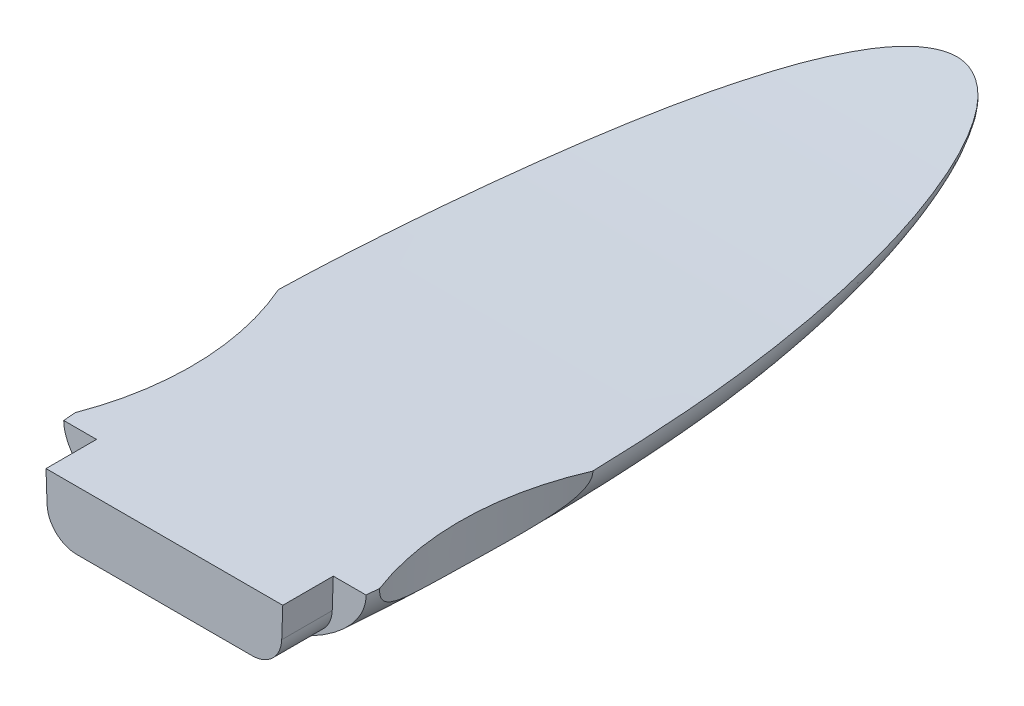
ISO-10303-21;
HEADER;
FILE_DESCRIPTION(('STEP AP214'),'2;1');
FILE_NAME('part.step','',(''),(''),'','','');
FILE_SCHEMA(('AUTOMOTIVE_DESIGN { 1 0 10303 214 1 1 1 1 }'));
ENDSEC;
DATA;
#1=APPLICATION_CONTEXT('core data for automotive mechanical design processes');
#2=APPLICATION_PROTOCOL_DEFINITION('international standard','automotive_design',2000,#1);
#3=PRODUCT_CONTEXT('',#1,'mechanical');
#4=PRODUCT('Part','Part','',(#3));
#5=PRODUCT_RELATED_PRODUCT_CATEGORY('part','',(#4));
#6=PRODUCT_DEFINITION_FORMATION('','',#4);
#7=PRODUCT_DEFINITION_CONTEXT('part definition',#1,'design');
#8=PRODUCT_DEFINITION('design','',#6,#7);
#9=PRODUCT_DEFINITION_SHAPE('','',#8);
#10=(LENGTH_UNIT() NAMED_UNIT(*) SI_UNIT(.MILLI.,.METRE.));
#11=(NAMED_UNIT(*) PLANE_ANGLE_UNIT() SI_UNIT($,.RADIAN.));
#12=(NAMED_UNIT(*) SI_UNIT($,.STERADIAN.) SOLID_ANGLE_UNIT());
#13=UNCERTAINTY_MEASURE_WITH_UNIT(LENGTH_MEASURE(1.E-05),#10,'distance_accuracy_value','');
#14=(GEOMETRIC_REPRESENTATION_CONTEXT(3) GLOBAL_UNCERTAINTY_ASSIGNED_CONTEXT((#13)) GLOBAL_UNIT_ASSIGNED_CONTEXT((#10,
#11,#12)) REPRESENTATION_CONTEXT('',''));
#15=CARTESIAN_POINT('',(0.,0.,0.));
#16=DIRECTION('',(0.,0.,1.));
#17=DIRECTION('',(1.,0.,0.));
#18=AXIS2_PLACEMENT_3D('',#15,#16,#17);
#19=CARTESIAN_POINT('',(-19.05,0.,33.02));
#20=CARTESIAN_POINT('',(-19.05,0.,18.415));
#21=CARTESIAN_POINT('',(-19.05,0.,3.81));
#22=CARTESIAN_POINT('',(-19.05,0.,-10.795));
#23=CARTESIAN_POINT('',(-19.05,0.,-12.4177777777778));
#24=CARTESIAN_POINT('',(-19.05,0.,-15.6633333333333));
#25=CARTESIAN_POINT('',(-19.05,0.,-20.5316666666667));
#26=CARTESIAN_POINT('',(-19.05,0.,-23.7772222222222));
#27=CARTESIAN_POINT('',(-19.05,0.,-25.4));
#28=CARTESIAN_POINT('',(-19.05,0.,-26.3538391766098));
#29=CARTESIAN_POINT('',(-19.05,0.,-28.2615175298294));
#30=CARTESIAN_POINT('',(-19.05,0.0404519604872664,-31.1230563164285));
#31=CARTESIAN_POINT('',(-19.05,0.0772232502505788,-33.0303944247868));
#32=CARTESIAN_POINT('',(-19.05,0.0992851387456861,-33.9839784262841));
#33=CARTESIAN_POINT('',(-19.05,0.297886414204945,-42.5681483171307));
#34=CARTESIAN_POINT('',(-19.05,0.794157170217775,-51.1402618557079));
#35=CARTESIAN_POINT('',(-19.05,1.58750000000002,-59.69));
#36=(BOUNDED_CURVE() B_SPLINE_CURVE(3,(#19,#20,#21,#22,#23,#24,#25,#26,#27,#28,#29,#30,#31,#32,
#33,#34,#35),.UNSPECIFIED.,.F.,.F.) B_SPLINE_CURVE_WITH_KNOTS((4,3,1,1,3,1,1,3,4),(0.,
0.472380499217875,0.524867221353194,0.577353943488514,0.629840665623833,0.660691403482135,
0.691542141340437,0.722392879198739,1.),
.UNSPECIFIED.) CURVE() GEOMETRIC_REPRESENTATION_ITEM() RATIONAL_B_SPLINE_CURVE((1.,1.,1.,1.,1.,
1.,1.,1.,1.,1.,1.,1.,1.,1.,0.999598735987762,0.999598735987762,1.)) REPRESENTATION_ITEM(''));
#37=DIRECTION('',(1.,0.,0.));
#38=VECTOR('',#37,1.);
#39=SURFACE_OF_LINEAR_EXTRUSION('',#36,#38);
#40=CARTESIAN_POINT('',(-12.1632335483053,-3.23227425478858E-12,0.));
#41=CARTESIAN_POINT('',(-12.1745918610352,-1.69889769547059E-09,-0.139833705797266));
#42=CARTESIAN_POINT('',(-12.2798559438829,-1.74136142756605E-08,-1.43575389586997));
#43=CARTESIAN_POINT('',(-12.4314445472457,7.12713352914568E-07,-3.66250264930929));
#44=CARTESIAN_POINT('',(-12.5490994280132,5.28545570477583E-07,-6.10297875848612));
#45=CARTESIAN_POINT('',(-12.6331584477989,-1.3350768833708E-06,-8.40930487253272));
#46=CARTESIAN_POINT('',(-12.7054368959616,-2.88137213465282E-06,-11.4351889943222));
#47=CARTESIAN_POINT('',(-12.7065061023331,2.04445103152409E-05,-15.2053945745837));
#48=CARTESIAN_POINT('',(-12.6241915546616,-0.000311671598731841,-18.656750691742));
#49=CARTESIAN_POINT('',(-12.5312367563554,-0.000405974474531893,-20.9518172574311));
#50=CARTESIAN_POINT('',(-12.4211647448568,-0.000289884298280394,-23.084403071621));
#51=CARTESIAN_POINT('',(-12.3165998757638,-0.000801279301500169,-24.6917051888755));
#52=CARTESIAN_POINT('',(-12.2199839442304,-2.71728384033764E-05,-25.9629804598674));
#53=CARTESIAN_POINT('',(-12.1099386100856,0.00452222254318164,-27.3432067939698));
#54=CARTESIAN_POINT('',(-11.9952710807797,0.0100432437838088,-28.609613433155));
#55=CARTESIAN_POINT('',(-11.7780765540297,0.0341330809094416,-30.7220597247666));
#56=CARTESIAN_POINT('',(-11.5819867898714,0.0616140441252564,-32.42902230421));
#57=CARTESIAN_POINT('',(-11.2907258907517,0.1113440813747,-34.588795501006));
#58=CARTESIAN_POINT('',(-11.0640373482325,0.153575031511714,-36.1155745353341));
#59=CARTESIAN_POINT('',(-10.8714724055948,0.190544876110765,-37.3042774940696));
#60=CARTESIAN_POINT('',(-10.5156036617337,0.260587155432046,-39.4040157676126));
#61=CARTESIAN_POINT('',(-10.110624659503,0.34568148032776,-41.5090045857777));
#62=CARTESIAN_POINT('',(-9.59975314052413,0.452802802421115,-43.7300091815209));
#63=CARTESIAN_POINT('',(-9.04189592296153,0.569001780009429,-46.0200825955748));
#64=CARTESIAN_POINT('',(-8.38068632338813,0.703605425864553,-48.3356925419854));
#65=CARTESIAN_POINT('',(-7.07844121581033,0.945186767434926,-51.9176325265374));
#66=CARTESIAN_POINT('',(-6.21013967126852,1.09744261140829,-53.9629936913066));
#67=CARTESIAN_POINT('',(-5.08028434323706,1.24920999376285,-55.8267812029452));
#68=CARTESIAN_POINT('',(-4.58376180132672,1.31215977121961,-56.584474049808));
#69=CARTESIAN_POINT('',(-3.67738013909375,1.41629330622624,-57.8045186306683));
#70=CARTESIAN_POINT('',(-2.10865705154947,1.54346163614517,-59.2173715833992));
#71=CARTESIAN_POINT('',(-0.703313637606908,1.58750000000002,-59.69));
#72=CARTESIAN_POINT('',(0.,1.5875,-59.69));
#73=B_SPLINE_CURVE_WITH_KNOTS('',3,(#40,#41,#42,#43,#44,#45,#46,#47,#48,#49,#50,#51,#52,#53,#54,
#55,#56,#57,#58,#59,#60,#61,#62,#63,#64,#65,#66,#67,#68,#69,#70,#71,#72),.UNSPECIFIED.,.F.,.F.,
(4,1,1,1,1,1,1,1,1,1,1,1,1,1,1,1,1,1,1,1,1,1,1,1,1,1,1,1,1,1,4),(0.,0.00674393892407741,0.0625,
0.107436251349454,0.125,0.174761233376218,0.25556567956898,0.3125,0.350466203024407,0.375,
0.425405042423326,0.4375,0.443992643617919,0.5,0.506246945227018,0.558526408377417,0.59375,
0.625,0.641327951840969,0.65625,0.734375,0.750990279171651,0.765625,0.84542227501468,0.859375,
0.921875,0.929549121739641,0.9375,0.953125,0.977506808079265,1.),.UNSPECIFIED.);
#74=CARTESIAN_POINT('',(-12.1632335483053,-3.23227425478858E-12,0.));
#75=VERTEX_POINT('',#74);
#76=CARTESIAN_POINT('',(-12.243580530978,4.27958049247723E-08,-1.01683520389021));
#77=VERTEX_POINT('',#76);
#78=EDGE_CURVE('E238',#75,#77,#73,.T.);
#79=ORIENTED_EDGE('',*,*,#78,.F.);
#80=DIRECTION('',(1.,0.,0.));
#81=VECTOR('',#80,1.);
#82=CARTESIAN_POINT('',(-19.05,0.,0.));
#83=LINE('',#82,#81);
#84=CARTESIAN_POINT('',(-9.525,0.,0.));
#85=VERTEX_POINT('',#84);
#86=EDGE_CURVE('E179',#75,#85,#83,.T.);
#87=ORIENTED_EDGE('',*,*,#86,.T.);
#88=DIRECTION('',(0.,0.,-1.));
#89=VECTOR('',#88,1.);
#90=CARTESIAN_POINT('',(-9.525,0.,4.064));
#91=LINE('',#90,#89);
#92=CARTESIAN_POINT('',(-9.525,0.,4.064));
#93=VERTEX_POINT('',#92);
#94=EDGE_CURVE('E369',#93,#85,#91,.T.);
#95=ORIENTED_EDGE('',*,*,#94,.F.);
#96=DIRECTION('',(1.,0.,0.));
#97=VECTOR('',#96,1.);
#98=CARTESIAN_POINT('',(-19.05,0.,4.064));
#99=LINE('',#98,#97);
#100=CARTESIAN_POINT('',(9.525,0.,4.064));
#101=VERTEX_POINT('',#100);
#102=EDGE_CURVE('E141',#101,#93,#99,.F.);
#103=ORIENTED_EDGE('',*,*,#102,.F.);
#104=DIRECTION('',(0.,0.,-1.));
#105=VECTOR('',#104,1.);
#106=CARTESIAN_POINT('',(9.525,0.,4.064));
#107=LINE('',#106,#105);
#108=CARTESIAN_POINT('',(9.525,0.,0.));
#109=VERTEX_POINT('',#108);
#110=EDGE_CURVE('E11',#101,#109,#107,.T.);
#111=ORIENTED_EDGE('',*,*,#110,.T.);
#112=CARTESIAN_POINT('',(12.1632335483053,-3.23227425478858E-12,0.));
#113=VERTEX_POINT('',#112);
#114=EDGE_CURVE('E290',#109,#113,#83,.T.);
#115=ORIENTED_EDGE('',*,*,#114,.T.);
#116=CARTESIAN_POINT('',(12.1632335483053,0.,0.));
#117=CARTESIAN_POINT('',(12.16723688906,0.,-0.0492870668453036));
#118=CARTESIAN_POINT('',(12.1712292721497,0.,-0.0985750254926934));
#119=CARTESIAN_POINT('',(12.1790289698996,0.,-0.195173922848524));
#120=CARTESIAN_POINT('',(12.1828372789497,0.,-0.242484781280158));
#121=CARTESIAN_POINT('',(12.1902688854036,0.,-0.335129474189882));
#122=CARTESIAN_POINT('',(12.1938932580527,0.,-0.38046322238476));
#123=CARTESIAN_POINT('',(12.2009568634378,0.,-0.469153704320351));
#124=CARTESIAN_POINT('',(12.2043972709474,0.,-0.512510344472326));
#125=CARTESIAN_POINT('',(12.211092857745,0.,-0.59724661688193));
#126=CARTESIAN_POINT('',(12.2143493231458,0.,-0.638626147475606));
#127=CARTESIAN_POINT('',(12.2206768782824,0.,-0.719408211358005));
#128=CARTESIAN_POINT('',(12.2237493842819,0.,-0.758810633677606));
#129=CARTESIAN_POINT('',(12.2297089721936,0.,-0.835638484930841));
#130=CARTESIAN_POINT('',(12.2325976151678,0.,-0.873063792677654));
#131=CARTESIAN_POINT('',(12.2381890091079,0.,-0.945937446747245));
#132=CARTESIAN_POINT('',(12.2408935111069,0.,-0.981385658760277));
#133=CARTESIAN_POINT('',(12.2435805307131,0.,-1.01683520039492));
#134=B_SPLINE_CURVE_WITH_KNOTS('',3,(#116,#117,#118,#119,#120,#121,#122,#123,#124,#125,#126,
#127,#128,#129,#130,#131,#132,#133),.UNSPECIFIED.,.F.,.F.,(4,2,2,2,2,2,2,2,4),(0.,
0.148348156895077,0.290739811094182,0.427175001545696,0.557653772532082,0.682176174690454,
0.800742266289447,0.913352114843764,1.0200057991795),.UNSPECIFIED.);
#135=CARTESIAN_POINT('',(12.243580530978,4.27958049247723E-08,-1.01683520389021));
#136=VERTEX_POINT('',#135);
#137=EDGE_CURVE('E43',#113,#136,#134,.T.);
#138=ORIENTED_EDGE('',*,*,#137,.T.);
#139=CARTESIAN_POINT('',(32.9613089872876,0.,-8.89852167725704));
#140=DIRECTION('',(0.,1.,0.));
#141=DIRECTION('',(0.,0.,1.));
#142=AXIS2_PLACEMENT_3D('',#139,#140,#141);
#143=CIRCLE('',#142,22.1663089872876);
#144=CARTESIAN_POINT('',(12.6423830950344,-5.47900580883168E-05,-17.7577874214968));
#145=VERTEX_POINT('',#144);
#146=EDGE_CURVE('E240',#145,#136,#143,.T.);
#147=ORIENTED_EDGE('',*,*,#146,.F.);
#148=CARTESIAN_POINT('',(12.6423830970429,0.,-17.7577826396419));
#149=CARTESIAN_POINT('',(12.6331635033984,2.36442304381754E-08,-18.1098768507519));
#150=CARTESIAN_POINT('',(12.6228317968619,1.17994458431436E-08,-18.4619421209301));
#151=CARTESIAN_POINT('',(12.5999624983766,-1.17542806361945E-08,-19.1646519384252));
#152=CARTESIAN_POINT('',(12.5874335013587,-2.34635689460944E-08,-19.5152967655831));
#153=CARTESIAN_POINT('',(12.5601696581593,2.33743733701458E-08,-20.2151657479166));
#154=CARTESIAN_POINT('',(12.5454433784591,8.16546965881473E-08,-20.56439023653));
#155=CARTESIAN_POINT('',(12.5137850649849,-8.13465049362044E-08,-21.2614184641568));
#156=CARTESIAN_POINT('',(12.4968615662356,-3.01573701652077E-07,-21.6092225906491));
#157=CARTESIAN_POINT('',(12.4608085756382,3.00443896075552E-07,-22.3034100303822));
#158=CARTESIAN_POINT('',(12.4416875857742,1.11878629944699E-06,-22.6497937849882));
#159=CARTESIAN_POINT('',(12.401240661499,-1.11462715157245E-06,-23.3411404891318));
#160=CARTESIAN_POINT('',(12.3799231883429,-4.15200701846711E-06,-23.6861039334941));
#161=CARTESIAN_POINT('',(12.3347448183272,4.19856934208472E-06,-24.3797493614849));
#162=CARTESIAN_POINT('',(12.3108580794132,1.5748679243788E-05,-24.7284296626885));
#163=CARTESIAN_POINT('',(12.2607650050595,-1.57277746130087E-05,-25.4251584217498));
#164=CARTESIAN_POINT('',(12.2345617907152,-5.86819142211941E-05,-25.7732071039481));
#165=CARTESIAN_POINT('',(12.1798291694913,0.00027430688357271,-26.468672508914));
#166=CARTESIAN_POINT('',(12.151302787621,0.000649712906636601,-26.8160894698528));
#167=CARTESIAN_POINT('',(12.0913774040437,0.00252272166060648,-27.5170129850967));
#168=CARTESIAN_POINT('',(12.0599357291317,0.00404052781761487,-27.8705158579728));
#169=CARTESIAN_POINT('',(11.9950602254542,0.00888033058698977,-28.5717407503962));
#170=CARTESIAN_POINT('',(11.9616653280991,0.0121736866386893,-28.9194665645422));
#171=CARTESIAN_POINT('',(11.8928743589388,0.0200844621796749,-29.6091298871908));
#172=CARTESIAN_POINT('',(11.8575184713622,0.0246800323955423,-29.9510716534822));
#173=CARTESIAN_POINT('',(11.8208674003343,0.029757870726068,-30.292866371));
#174=B_SPLINE_CURVE_WITH_KNOTS('',3,(#148,#149,#150,#151,#152,#153,#154,#155,#156,#157,#158,
#159,#160,#161,#162,#163,#164,#165,#166,#167,#168,#169,#170,#171,#172,#173),.UNSPECIFIED.,.F.,
.F.,(4,2,2,2,2,2,2,2,2,2,2,2,4),(0.,1.05664319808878,2.1092418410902,3.157839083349,
4.20247857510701,5.24320446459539,6.28006139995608,7.32854607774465,8.37563900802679,
9.42138966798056,10.4860822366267,11.5340932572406,12.5654672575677),.UNSPECIFIED.);
#175=CARTESIAN_POINT('',(11.8208674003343,0.0297578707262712,-30.2928663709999));
#176=VERTEX_POINT('',#175);
#177=EDGE_CURVE('E254',#145,#176,#174,.T.);
#178=ORIENTED_EDGE('',*,*,#177,.T.);
#179=CARTESIAN_POINT('',(11.8208674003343,0.029757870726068,-30.292866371));
#180=CARTESIAN_POINT('',(11.8009739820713,0.0325197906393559,-30.4783865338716));
#181=CARTESIAN_POINT('',(11.7806856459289,0.0354064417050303,-30.6638624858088));
#182=CARTESIAN_POINT('',(11.7393904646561,0.04138482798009,-31.0340031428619));
#183=CARTESIAN_POINT('',(11.7183867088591,0.0444757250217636,-31.2186682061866));
#184=CARTESIAN_POINT('',(11.6756609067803,0.0508278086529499,-31.5871867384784));
#185=CARTESIAN_POINT('',(11.6539419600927,0.0540882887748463,-31.7710405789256));
#186=CARTESIAN_POINT('',(11.6097845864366,0.0608052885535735,-32.1379363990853));
#187=CARTESIAN_POINT('',(11.5873492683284,0.0642610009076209,-32.3209787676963));
#188=CARTESIAN_POINT('',(11.5417637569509,0.0713802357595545,-32.6862524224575));
#189=CARTESIAN_POINT('',(11.5186166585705,0.0750429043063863,-32.8684841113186));
#190=CARTESIAN_POINT('',(11.4715904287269,0.0825905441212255,-33.2321342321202));
#191=CARTESIAN_POINT('',(11.4477144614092,0.0864746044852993,-33.4135530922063));
#192=CARTESIAN_POINT('',(11.3982925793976,0.0946454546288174,-33.7830747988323));
#193=CARTESIAN_POINT('',(11.3727176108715,0.0989418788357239,-33.9711735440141));
#194=CARTESIAN_POINT('',(11.3211806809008,0.107750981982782,-34.3443466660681));
#195=CARTESIAN_POINT('',(11.2952308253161,0.112259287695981,-34.5294228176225));
#196=CARTESIAN_POINT('',(11.2429261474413,0.121476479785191,-34.8965490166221));
#197=CARTESIAN_POINT('',(11.2165840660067,0.126181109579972,-35.0786009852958));
#198=CARTESIAN_POINT('',(11.1634978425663,0.13577805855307,-35.4396787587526));
#199=CARTESIAN_POINT('',(11.1367667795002,0.140666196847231,-35.6187065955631));
#200=CARTESIAN_POINT('',(11.0962066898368,0.148159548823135,-35.8860628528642));
#201=CARTESIAN_POINT('',(11.0826942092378,0.150668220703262,-35.9744420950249));
#202=CARTESIAN_POINT('',(11.0553671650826,0.155763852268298,-36.1517256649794));
#203=CARTESIAN_POINT('',(11.0415512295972,0.158351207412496,-36.2406297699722));
#204=CARTESIAN_POINT('',(10.9994965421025,0.166259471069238,-36.5090485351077));
#205=CARTESIAN_POINT('',(10.9709180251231,0.171677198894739,-36.6885072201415));
#206=CARTESIAN_POINT('',(10.9125227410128,0.182841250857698,-37.0496274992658));
#207=CARTESIAN_POINT('',(10.8826946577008,0.188590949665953,-37.2312871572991));
#208=CARTESIAN_POINT('',(10.8217934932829,0.200428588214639,-37.5968076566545));
#209=CARTESIAN_POINT('',(10.7907092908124,0.206519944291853,-37.7806665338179));
#210=CARTESIAN_POINT('',(10.7273150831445,0.219050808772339,-38.1505880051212));
#211=CARTESIAN_POINT('',(10.6949944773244,0.225493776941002,-38.3366486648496));
#212=CARTESIAN_POINT('',(10.6289411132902,0.238760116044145,-38.7116041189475));
#213=CARTESIAN_POINT('',(10.5951939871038,0.245587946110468,-38.9004962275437));
#214=CARTESIAN_POINT('',(10.5271838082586,0.259420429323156,-39.2752489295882));
#215=CARTESIAN_POINT('',(10.4929361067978,0.266420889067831,-39.4611124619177));
#216=CARTESIAN_POINT('',(10.4239445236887,0.280585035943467,-39.8298111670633));
#217=CARTESIAN_POINT('',(10.3892161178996,0.287744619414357,-40.0126493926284));
#218=CARTESIAN_POINT('',(10.3192564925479,0.302213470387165,-40.3752959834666));
#219=CARTESIAN_POINT('',(10.284041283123,0.309518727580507,-40.5551075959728));
#220=CARTESIAN_POINT('',(10.2131125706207,0.324265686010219,-40.9117016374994));
#221=CARTESIAN_POINT('',(10.1774154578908,0.331703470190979,-41.0884874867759));
#222=CARTESIAN_POINT('',(10.1055089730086,0.346702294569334,-41.4390268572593));
#223=CARTESIAN_POINT('',(10.0693166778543,0.354259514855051,-41.6127840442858));
#224=CARTESIAN_POINT('',(9.99210713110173,0.370396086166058,-41.9778946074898));
#225=CARTESIAN_POINT('',(9.95097603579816,0.379000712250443,-42.1692228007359));
#226=CARTESIAN_POINT('',(9.86803654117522,0.396366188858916,-42.5488152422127));
#227=CARTESIAN_POINT('',(9.82624659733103,0.405122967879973,-42.7370837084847));
#228=CARTESIAN_POINT('',(9.74197467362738,0.422778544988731,-43.1105533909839));
#229=CARTESIAN_POINT('',(9.69951182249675,0.431673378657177,-43.2957591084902));
#230=CARTESIAN_POINT('',(9.61389732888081,0.449591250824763,-43.6631037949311));
#231=CARTESIAN_POINT('',(9.57076524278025,0.458610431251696,-43.8452475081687));
#232=CARTESIAN_POINT('',(9.48381088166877,0.476763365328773,-44.2064677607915));
#233=CARTESIAN_POINT('',(9.44000867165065,0.48589336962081,-44.3855493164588));
#234=CARTESIAN_POINT('',(9.35171354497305,0.504254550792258,-44.7406450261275));
#235=CARTESIAN_POINT('',(9.30724120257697,0.513482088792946,-44.9166644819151));
#236=CARTESIAN_POINT('',(9.21760621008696,0.53202517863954,-45.265636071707));
#237=CARTESIAN_POINT('',(9.17246464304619,0.541337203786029,-45.438593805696));
#238=CARTESIAN_POINT('',(9.08148709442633,0.560036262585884,-45.7814408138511));
#239=CARTESIAN_POINT('',(9.03567278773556,0.569419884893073,-45.9513360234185));
#240=CARTESIAN_POINT('',(8.94336230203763,0.58824962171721,-46.2880614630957));
#241=CARTESIAN_POINT('',(8.89688814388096,0.597692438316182,-46.454897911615));
#242=CARTESIAN_POINT('',(8.7983746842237,0.617604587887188,-46.8025554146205));
#243=CARTESIAN_POINT('',(8.74620176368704,0.628092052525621,-46.9833376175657));
#244=CARTESIAN_POINT('',(8.64034894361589,0.649235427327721,-47.3432624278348));
#245=CARTESIAN_POINT('',(8.58668003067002,0.659889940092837,-47.5224083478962));
#246=CARTESIAN_POINT('',(8.47784920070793,0.681360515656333,-47.8790644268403));
#247=CARTESIAN_POINT('',(8.42269810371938,0.692175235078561,-48.0565779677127));
#248=CARTESIAN_POINT('',(8.31089926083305,0.713959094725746,-48.4099679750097));
#249=CARTESIAN_POINT('',(8.25426226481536,0.724926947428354,-48.5858479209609));
#250=CARTESIAN_POINT('',(8.13949286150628,0.747010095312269,-48.9359709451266));
#251=CARTESIAN_POINT('',(8.08137109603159,0.758124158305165,-49.1102175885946));
#252=CARTESIAN_POINT('',(7.96363139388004,0.780492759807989,-49.457073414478));
#253=CARTESIAN_POINT('',(7.90402399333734,0.79174612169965,-49.629686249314));
#254=CARTESIAN_POINT('',(7.78331544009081,0.814386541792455,-49.9732757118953));
#255=CARTESIAN_POINT('',(7.7222246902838,0.825772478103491,-50.1442560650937));
#256=CARTESIAN_POINT('',(7.62933229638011,0.842970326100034,-50.3998528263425));
#257=CARTESIAN_POINT('',(7.59822597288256,0.848710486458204,-50.4847273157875));
#258=CARTESIAN_POINT('',(7.53246490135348,0.860807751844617,-50.6626914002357));
#259=CARTESIAN_POINT('',(7.49776344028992,0.86716973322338,-50.7557633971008));
#260=CARTESIAN_POINT('',(7.39515145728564,0.885911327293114,-51.0284337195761));
#261=CARTESIAN_POINT('',(7.32646642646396,0.898366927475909,-51.2077365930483));
#262=CARTESIAN_POINT('',(7.18988998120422,0.922893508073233,-51.5571521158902));
#263=CARTESIAN_POINT('',(7.12210751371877,0.934955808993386,-51.7273079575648));
#264=CARTESIAN_POINT('',(6.97140772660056,0.961456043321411,-52.0975321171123));
#265=CARTESIAN_POINT('',(6.88798541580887,0.975925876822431,-52.2973937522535));
#266=CARTESIAN_POINT('',(6.74563150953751,1.00016674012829,-52.6285237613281));
#267=CARTESIAN_POINT('',(6.68787632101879,1.00988501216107,-52.7603024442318));
#268=CARTESIAN_POINT('',(6.55259418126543,1.03236022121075,-53.062874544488));
#269=CARTESIAN_POINT('',(6.47438900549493,1.04514374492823,-53.2333636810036));
#270=CARTESIAN_POINT('',(6.3164994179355,1.0704901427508,-53.5683234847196));
#271=CARTESIAN_POINT('',(6.23690430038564,1.08305027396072,-53.7328364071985));
#272=CARTESIAN_POINT('',(6.07621282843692,1.10792455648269,-54.0558322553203));
#273=CARTESIAN_POINT('',(5.99520853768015,1.12023666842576,-54.2143610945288));
#274=CARTESIAN_POINT('',(5.82347044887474,1.14583167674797,-54.5412281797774));
#275=CARTESIAN_POINT('',(5.73246071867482,1.1591188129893,-54.7094213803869));
#276=CARTESIAN_POINT('',(5.54847732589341,1.18539126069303,-55.0391623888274));
#277=CARTESIAN_POINT('',(5.45561184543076,1.19837568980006,-55.2007705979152));
#278=CARTESIAN_POINT('',(5.26790331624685,1.22401618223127,-55.5173404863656));
#279=CARTESIAN_POINT('',(5.17316977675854,1.23667224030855,-55.6723668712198));
#280=CARTESIAN_POINT('',(5.00509681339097,1.25857661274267,-55.9386503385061));
#281=CARTESIAN_POINT('',(4.9327860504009,1.26783399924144,-56.0505589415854));
#282=CARTESIAN_POINT('',(4.72874916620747,1.2934857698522,-56.3589689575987));
#283=CARTESIAN_POINT('',(4.59442778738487,1.30984837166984,-56.5537809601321));
#284=CARTESIAN_POINT('',(4.39064393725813,1.33362583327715,-56.8343003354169));
#285=CARTESIAN_POINT('',(4.32487497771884,1.3411501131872,-56.922685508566));
#286=CARTESIAN_POINT('',(4.21425070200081,1.35350419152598,-57.0672042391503));
#287=CARTESIAN_POINT('',(4.17007959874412,1.35836072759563,-57.1238607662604));
#288=CARTESIAN_POINT('',(4.01048873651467,1.37561370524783,-57.3245990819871));
#289=CARTESIAN_POINT('',(3.89204970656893,1.38788106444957,-57.4663344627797));
#290=CARTESIAN_POINT('',(3.71085616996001,1.40569962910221,-57.6709020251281));
#291=CARTESIAN_POINT('',(3.6511631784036,1.41142689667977,-57.7364471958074));
#292=CARTESIAN_POINT('',(3.52578720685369,1.42314175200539,-57.8701180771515));
#293=CARTESIAN_POINT('',(3.45997166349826,1.42912086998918,-57.9381199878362));
#294=CARTESIAN_POINT('',(3.26336364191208,1.44646006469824,-58.1347189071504));
#295=CARTESIAN_POINT('',(3.12951749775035,1.45760805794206,-58.2603376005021));
#296=CARTESIAN_POINT('',(2.94093358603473,1.47229756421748,-58.4249811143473));
#297=CARTESIAN_POINT('',(2.88994933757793,1.47617280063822,-58.4683266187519));
#298=CARTESIAN_POINT('',(2.79180915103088,1.4834413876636,-58.5494719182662));
#299=CARTESIAN_POINT('',(2.74476187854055,1.48684500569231,-58.5874016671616));
#300=CARTESIAN_POINT('',(2.65052337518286,1.49349323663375,-58.6613654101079));
#301=CARTESIAN_POINT('',(2.60334917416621,1.49673959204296,-58.6974209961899));
#302=CARTESIAN_POINT('',(2.46280249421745,1.50615793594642,-58.8018603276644));
#303=CARTESIAN_POINT('',(2.36807396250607,1.51218260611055,-58.8684509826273));
#304=CARTESIAN_POINT('',(2.17797188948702,1.52356989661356,-58.9939670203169));
#305=CARTESIAN_POINT('',(2.08271698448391,1.52894757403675,-59.0530700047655));
#306=CARTESIAN_POINT('',(1.92289249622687,1.53737769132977,-59.1454989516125));
#307=CARTESIAN_POINT('',(1.85933674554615,1.54058179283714,-59.1805698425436));
#308=CARTESIAN_POINT('',(1.73222674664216,1.54667560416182,-59.2471737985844));
#309=CARTESIAN_POINT('',(1.66870570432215,1.54957082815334,-59.2787694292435));
#310=CARTESIAN_POINT('',(1.55725958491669,1.55437250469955,-59.3311029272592));
#311=CARTESIAN_POINT('',(1.50964767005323,1.55633810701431,-59.3525040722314));
#312=CARTESIAN_POINT('',(1.41443425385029,1.56009071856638,-59.3933259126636));
#313=CARTESIAN_POINT('',(1.36684369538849,1.56187999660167,-59.4127718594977));
#314=CARTESIAN_POINT('',(1.27167534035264,1.56527904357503,-59.4496836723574));
#315=CARTESIAN_POINT('',(1.22410705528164,1.56689101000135,-59.4671738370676));
#316=CARTESIAN_POINT('',(1.12898402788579,1.56993472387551,-59.5001756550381));
#317=CARTESIAN_POINT('',(1.08143735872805,1.57136856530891,-59.5157103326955));
#318=CARTESIAN_POINT('',(0.993271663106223,1.57386000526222,-59.5426868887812));
#319=CARTESIAN_POINT('',(0.952732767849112,1.57494136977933,-59.5543888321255));
#320=CARTESIAN_POINT('',(0.871740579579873,1.5769697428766,-59.5763287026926));
#321=CARTESIAN_POINT('',(0.831291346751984,1.57791811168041,-59.5865814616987));
#322=CARTESIAN_POINT('',(0.750479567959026,1.57968021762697,-59.6056239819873));
#323=CARTESIAN_POINT('',(0.710120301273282,1.58049522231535,-59.6144275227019));
#324=CARTESIAN_POINT('',(0.629489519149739,1.58199038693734,-59.6305727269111));
#325=CARTESIAN_POINT('',(0.589220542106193,1.58267170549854,-59.6379269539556));
#326=CARTESIAN_POINT('',(0.503070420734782,1.58398632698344,-59.6521133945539));
#327=CARTESIAN_POINT('',(0.45715587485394,1.58460116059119,-59.6587457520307));
#328=CARTESIAN_POINT('',(0.36544296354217,1.58565421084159,-59.6701028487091));
#329=CARTESIAN_POINT('',(0.319646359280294,1.58609373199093,-59.6748416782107));
#330=CARTESIAN_POINT('',(0.228169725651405,1.58679612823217,-59.6824138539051));
#331=CARTESIAN_POINT('',(0.182490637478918,1.5870600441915,-59.6852584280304));
#332=CARTESIAN_POINT('',(0.0912506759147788,1.58741163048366,-59.6890476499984));
#333=CARTESIAN_POINT('',(0.0456901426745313,1.58750005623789,-59.6900004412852));
#334=CARTESIAN_POINT('',(0.000128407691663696,1.58750000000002,-59.69));
#335=B_SPLINE_CURVE_WITH_KNOTS('',3,(#179,#180,#181,#182,#183,#184,#185,#186,#187,#188,#189,
#190,#191,#192,#193,#194,#195,#196,#197,#198,#199,#200,#201,#202,#203,#204,#205,#206,#207,#208,
#209,#210,#211,#212,#213,#214,#215,#216,#217,#218,#219,#220,#221,#222,#223,#224,#225,#226,#227,
#228,#229,#230,#231,#232,#233,#234,#235,#236,#237,#238,#239,#240,#241,#242,#243,#244,#245,#246,
#247,#248,#249,#250,#251,#252,#253,#254,#255,#256,#257,#258,#259,#260,#261,#262,#263,#264,#265,
#266,#267,#268,#269,#270,#271,#272,#273,#274,#275,#276,#277,#278,#279,#280,#281,#282,#283,#284,
#285,#286,#287,#288,#289,#290,#291,#292,#293,#294,#295,#296,#297,#298,#299,#300,#301,#302,#303,
#304,#305,#306,#307,#308,#309,#310,#311,#312,#313,#314,#315,#316,#317,#318,#319,#320,#321,#322,
#323,#324,#325,#326,#327,#328,#329,#330,#331,#332,#333,#334),.UNSPECIFIED.,.F.,.F.,(4,2,2,2,2,2,
2,2,2,2,2,2,2,2,2,2,2,2,2,2,2,2,2,2,2,2,2,2,2,2,2,2,2,2,2,2,2,2,2,2,2,2,2,2,2,2,2,2,2,2,2,2,2,2,
2,2,2,2,2,2,2,2,2,2,2,2,2,2,2,2,2,2,2,2,2,2,2,4),(0.,0.55981195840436,1.11745434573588,
1.67293534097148,2.2262671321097,2.77746231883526,3.32653375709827,3.89616603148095,
4.45698684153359,5.00900897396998,5.55224210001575,5.82056617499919,6.09059114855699,
6.63599073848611,7.18853446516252,7.74823467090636,8.3151031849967,8.89111379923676,
9.45847702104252,10.0172084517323,10.5673245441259,11.1088426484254,11.6417810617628,
12.2294417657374,12.8085855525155,13.379238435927,13.9414277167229,14.4951820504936,
15.040531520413,15.5775077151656,16.1061438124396,16.6264746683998,17.1918214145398,
17.7537584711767,18.3123423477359,18.8676306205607,19.4196819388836,19.9685560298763,
20.5143137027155,20.7860441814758,21.0846455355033,21.6618637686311,22.2125178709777,
22.8636399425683,23.2962484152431,23.8602255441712,24.4097470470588,24.9450566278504,
25.5200901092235,26.0805542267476,26.626835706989,27.0274955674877,27.7388188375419,
28.0700637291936,28.2860716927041,28.841096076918,29.1075772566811,29.3920180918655,
29.9432025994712,30.1442804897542,30.3258438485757,30.5042194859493,30.8518776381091,
31.1883593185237,31.4062829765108,31.6192228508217,31.7759070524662,31.9301986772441,
32.0822882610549,32.2323747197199,32.3589767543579,32.4841710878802,32.6080960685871,
32.7308943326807,32.8700415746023,33.0081331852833,33.1453988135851,33.2820722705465),.UNSPECIFIED.);
#336=CARTESIAN_POINT('',(0.,1.58750000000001,-59.69));
#337=VERTEX_POINT('',#336);
#338=EDGE_CURVE('E329',#176,#337,#335,.T.);
#339=ORIENTED_EDGE('',*,*,#338,.T.);
#340=CARTESIAN_POINT('',(-12.1632335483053,-3.23227425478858E-12,0.));
#341=CARTESIAN_POINT('',(-12.1745918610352,-1.69889769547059E-09,-0.139833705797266));
#342=CARTESIAN_POINT('',(-12.2798559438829,-1.74136142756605E-08,-1.43575389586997));
#343=CARTESIAN_POINT('',(-12.4314445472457,7.12713352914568E-07,-3.66250264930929));
#344=CARTESIAN_POINT('',(-12.5490994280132,5.28545570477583E-07,-6.10297875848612));
#345=CARTESIAN_POINT('',(-12.6331584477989,-1.3350768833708E-06,-8.40930487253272));
#346=CARTESIAN_POINT('',(-12.7054368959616,-2.88137213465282E-06,-11.4351889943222));
#347=CARTESIAN_POINT('',(-12.7065061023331,2.04445103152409E-05,-15.2053945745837));
#348=CARTESIAN_POINT('',(-12.6241915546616,-0.000311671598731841,-18.656750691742));
#349=CARTESIAN_POINT('',(-12.5312367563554,-0.000405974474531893,-20.9518172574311));
#350=CARTESIAN_POINT('',(-12.4211647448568,-0.000289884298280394,-23.084403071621));
#351=CARTESIAN_POINT('',(-12.3165998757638,-0.000801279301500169,-24.6917051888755));
#352=CARTESIAN_POINT('',(-12.2199839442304,-2.71728384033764E-05,-25.9629804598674));
#353=CARTESIAN_POINT('',(-12.1099386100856,0.00452222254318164,-27.3432067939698));
#354=CARTESIAN_POINT('',(-11.9952710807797,0.0100432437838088,-28.609613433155));
#355=CARTESIAN_POINT('',(-11.7780765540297,0.0341330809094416,-30.7220597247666));
#356=CARTESIAN_POINT('',(-11.5819867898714,0.0616140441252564,-32.42902230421));
#357=CARTESIAN_POINT('',(-11.2907258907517,0.1113440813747,-34.588795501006));
#358=CARTESIAN_POINT('',(-11.0640373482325,0.153575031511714,-36.1155745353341));
#359=CARTESIAN_POINT('',(-10.8714724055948,0.190544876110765,-37.3042774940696));
#360=CARTESIAN_POINT('',(-10.5156036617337,0.260587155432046,-39.4040157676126));
#361=CARTESIAN_POINT('',(-10.110624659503,0.34568148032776,-41.5090045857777));
#362=CARTESIAN_POINT('',(-9.59975314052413,0.452802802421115,-43.7300091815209));
#363=CARTESIAN_POINT('',(-9.04189592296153,0.569001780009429,-46.0200825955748));
#364=CARTESIAN_POINT('',(-8.38068632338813,0.703605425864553,-48.3356925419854));
#365=CARTESIAN_POINT('',(-7.07844121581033,0.945186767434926,-51.9176325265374));
#366=CARTESIAN_POINT('',(-6.21013967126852,1.09744261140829,-53.9629936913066));
#367=CARTESIAN_POINT('',(-5.08028434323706,1.24920999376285,-55.8267812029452));
#368=CARTESIAN_POINT('',(-4.58376180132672,1.31215977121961,-56.584474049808));
#369=CARTESIAN_POINT('',(-3.67738013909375,1.41629330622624,-57.8045186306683));
#370=CARTESIAN_POINT('',(-2.10865705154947,1.54346163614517,-59.2173715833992));
#371=CARTESIAN_POINT('',(-0.703313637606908,1.58750000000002,-59.69));
#372=CARTESIAN_POINT('',(0.,1.5875,-59.69));
#373=B_SPLINE_CURVE_WITH_KNOTS('',3,(#340,#341,#342,#343,#344,#345,#346,#347,#348,#349,#350,
#351,#352,#353,#354,#355,#356,#357,#358,#359,#360,#361,#362,#363,#364,#365,#366,#367,#368,#369,
#370,#371,#372),.UNSPECIFIED.,.F.,.F.,(4,1,1,1,1,1,1,1,1,1,1,1,1,1,1,1,1,1,1,1,1,1,1,1,1,1,1,1,
1,1,4),(0.,0.00674393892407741,0.0625,0.107436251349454,0.125,0.174761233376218,
0.25556567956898,0.3125,0.350466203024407,0.375,0.425405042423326,0.4375,0.443992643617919,0.5,
0.506246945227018,0.558526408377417,0.59375,0.625,0.641327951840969,0.65625,0.734375,
0.750990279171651,0.765625,0.84542227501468,0.859375,0.921875,0.929549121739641,0.9375,0.953125,
0.977506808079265,1.),.UNSPECIFIED.);
#374=CARTESIAN_POINT('',(-11.8208674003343,0.0297578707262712,-30.2928663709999));
#375=VERTEX_POINT('',#374);
#376=EDGE_CURVE('E235',#375,#337,#373,.T.);
#377=ORIENTED_EDGE('',*,*,#376,.F.);
#378=CARTESIAN_POINT('',(-12.1632335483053,-3.23227425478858E-12,0.));
#379=CARTESIAN_POINT('',(-12.1745918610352,-1.69889769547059E-09,-0.139833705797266));
#380=CARTESIAN_POINT('',(-12.2798559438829,-1.74136142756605E-08,-1.43575389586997));
#381=CARTESIAN_POINT('',(-12.4314445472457,7.12713352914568E-07,-3.66250264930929));
#382=CARTESIAN_POINT('',(-12.5490994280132,5.28545570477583E-07,-6.10297875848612));
#383=CARTESIAN_POINT('',(-12.6331584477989,-1.3350768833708E-06,-8.40930487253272));
#384=CARTESIAN_POINT('',(-12.7054368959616,-2.88137213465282E-06,-11.4351889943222));
#385=CARTESIAN_POINT('',(-12.7065061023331,2.04445103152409E-05,-15.2053945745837));
#386=CARTESIAN_POINT('',(-12.6241915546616,-0.000311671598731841,-18.656750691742));
#387=CARTESIAN_POINT('',(-12.5312367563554,-0.000405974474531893,-20.9518172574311));
#388=CARTESIAN_POINT('',(-12.4211647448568,-0.000289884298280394,-23.084403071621));
#389=CARTESIAN_POINT('',(-12.3165998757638,-0.000801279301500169,-24.6917051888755));
#390=CARTESIAN_POINT('',(-12.2199839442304,-2.71728384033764E-05,-25.9629804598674));
#391=CARTESIAN_POINT('',(-12.1099386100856,0.00452222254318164,-27.3432067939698));
#392=CARTESIAN_POINT('',(-11.9952710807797,0.0100432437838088,-28.609613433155));
#393=CARTESIAN_POINT('',(-11.7780765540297,0.0341330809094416,-30.7220597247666));
#394=CARTESIAN_POINT('',(-11.5819867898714,0.0616140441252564,-32.42902230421));
#395=CARTESIAN_POINT('',(-11.2907258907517,0.1113440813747,-34.588795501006));
#396=CARTESIAN_POINT('',(-11.0640373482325,0.153575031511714,-36.1155745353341));
#397=CARTESIAN_POINT('',(-10.8714724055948,0.190544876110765,-37.3042774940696));
#398=CARTESIAN_POINT('',(-10.5156036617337,0.260587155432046,-39.4040157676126));
#399=CARTESIAN_POINT('',(-10.110624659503,0.34568148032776,-41.5090045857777));
#400=CARTESIAN_POINT('',(-9.59975314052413,0.452802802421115,-43.7300091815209));
#401=CARTESIAN_POINT('',(-9.04189592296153,0.569001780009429,-46.0200825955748));
#402=CARTESIAN_POINT('',(-8.38068632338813,0.703605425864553,-48.3356925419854));
#403=CARTESIAN_POINT('',(-7.07844121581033,0.945186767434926,-51.9176325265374));
#404=CARTESIAN_POINT('',(-6.21013967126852,1.09744261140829,-53.9629936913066));
#405=CARTESIAN_POINT('',(-5.08028434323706,1.24920999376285,-55.8267812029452));
#406=CARTESIAN_POINT('',(-4.58376180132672,1.31215977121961,-56.584474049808));
#407=CARTESIAN_POINT('',(-3.67738013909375,1.41629330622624,-57.8045186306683));
#408=CARTESIAN_POINT('',(-2.10865705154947,1.54346163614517,-59.2173715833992));
#409=CARTESIAN_POINT('',(-0.703313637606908,1.58750000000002,-59.69));
#410=CARTESIAN_POINT('',(0.,1.5875,-59.69));
#411=B_SPLINE_CURVE_WITH_KNOTS('',3,(#378,#379,#380,#381,#382,#383,#384,#385,#386,#387,#388,
#389,#390,#391,#392,#393,#394,#395,#396,#397,#398,#399,#400,#401,#402,#403,#404,#405,#406,#407,
#408,#409,#410),.UNSPECIFIED.,.F.,.F.,(4,1,1,1,1,1,1,1,1,1,1,1,1,1,1,1,1,1,1,1,1,1,1,1,1,1,1,1,
1,1,4),(0.,0.00674393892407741,0.0625,0.107436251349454,0.125,0.174761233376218,
0.25556567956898,0.3125,0.350466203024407,0.375,0.425405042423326,0.4375,0.443992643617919,0.5,
0.506246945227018,0.558526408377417,0.59375,0.625,0.641327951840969,0.65625,0.734375,
0.750990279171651,0.765625,0.84542227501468,0.859375,0.921875,0.929549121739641,0.9375,0.953125,
0.977506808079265,1.),.UNSPECIFIED.);
#412=CARTESIAN_POINT('',(-12.2383432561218,9.41122792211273E-06,-25.7198029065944));
#413=VERTEX_POINT('',#412);
#414=EDGE_CURVE('E180',#413,#375,#411,.T.);
#415=ORIENTED_EDGE('',*,*,#414,.F.);
#416=CARTESIAN_POINT('',(-12.2383432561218,9.41122792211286E-06,-25.7198029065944));
#417=CARTESIAN_POINT('',(-12.2632434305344,3.38493399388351E-06,-25.3921711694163));
#418=CARTESIAN_POINT('',(-12.2870991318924,9.0838682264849E-07,-25.0644601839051));
#419=CARTESIAN_POINT('',(-12.3328101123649,-9.11186397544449E-07,-24.4078838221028));
#420=CARTESIAN_POINT('',(-12.3546589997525,-2.44531664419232E-07,-24.0790180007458));
#421=CARTESIAN_POINT('',(-12.3963563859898,2.45292706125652E-07,-23.4201320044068));
#422=CARTESIAN_POINT('',(-12.4161984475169,6.58307565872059E-08,-23.0901114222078));
#423=CARTESIAN_POINT('',(-12.4538822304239,-6.60375890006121E-08,-22.4289158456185));
#424=CARTESIAN_POINT('',(-12.4717174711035,-1.77288319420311E-08,-22.0977404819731));
#425=CARTESIAN_POINT('',(-12.5053876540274,1.7785047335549E-08,-21.4342353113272));
#426=CARTESIAN_POINT('',(-12.5212160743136,4.79593363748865E-09,-21.1019051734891));
#427=CARTESIAN_POINT('',(-12.5508726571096,-4.81127650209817E-09,-20.4360904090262));
#428=CARTESIAN_POINT('',(-12.5646942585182,-1.37686682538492E-09,-20.1026054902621));
#429=CARTESIAN_POINT('',(-12.5903372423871,1.38130965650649E-09,-19.4344811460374));
#430=CARTESIAN_POINT('',(-12.602152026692,6.91776607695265E-10,-19.0998414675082));
#431=CARTESIAN_POINT('',(-12.6237814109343,-6.94027466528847E-10,-18.429407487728));
#432=CARTESIAN_POINT('',(-12.6335893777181,-1.39031311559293E-09,-18.0936129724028));
#433=CARTESIAN_POINT('',(-12.6423828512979,0.,-17.7577920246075));
#434=B_SPLINE_CURVE_WITH_KNOTS('',3,(#416,#417,#418,#419,#420,#421,#422,#423,#424,#425,#426,
#427,#428,#429,#430,#431,#432,#433),.UNSPECIFIED.,.F.,.F.,(4,2,2,2,2,2,2,2,4),(0.,
0.985727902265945,1.97449373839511,2.96633685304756,3.96129622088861,4.95941045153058,
5.96071778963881,6.96525611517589,7.97306294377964),.UNSPECIFIED.);
#435=CARTESIAN_POINT('',(-12.6423848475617,-5.47686602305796E-05,-17.7577914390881));
#436=VERTEX_POINT('',#435);
#437=EDGE_CURVE('E251',#413,#436,#434,.T.);
#438=ORIENTED_EDGE('',*,*,#437,.T.);
#439=CARTESIAN_POINT('',(-32.9613089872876,0.,-8.89852167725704));
#440=DIRECTION('',(0.,-1.,0.));
#441=DIRECTION('',(0.,0.,1.));
#442=AXIS2_PLACEMENT_3D('',#439,#440,#441);
#443=CIRCLE('',#442,22.1663089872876);
#444=EDGE_CURVE('E37',#436,#77,#443,.T.);
#445=ORIENTED_EDGE('',*,*,#444,.T.);
#446=EDGE_LOOP('',(#79,#87,#95,#103,#111,#115,#138,#147,#178,#339,#377,#415,#438,#445));
#447=FACE_BOUND('',#446,.T.);
#448=ADVANCED_FACE('F32',(#447),#39,.F.);
#449=CARTESIAN_POINT('',(32.9613089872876,0.,-8.89852167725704));
#450=DIRECTION('',(0.,-1.,0.));
#451=DIRECTION('',(0.,0.,1.));
#452=AXIS2_PLACEMENT_3D('',#449,#450,#451);
#453=CONICAL_SURFACE('',#452,22.1663089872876,0.0349065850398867);
#454=CARTESIAN_POINT('',(12.2435805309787,4.27957152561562E-08,-1.01683520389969));
#455=CARTESIAN_POINT('',(12.243376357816,-0.0338412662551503,-1.01405023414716));
#456=CARTESIAN_POINT('',(12.2426046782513,-0.0677909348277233,-1.01274378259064));
#457=CARTESIAN_POINT('',(12.2399736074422,-0.135598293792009,-1.01299895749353));
#458=CARTESIAN_POINT('',(12.2381155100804,-0.169456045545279,-1.01455717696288));
#459=CARTESIAN_POINT('',(12.2333856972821,-0.236463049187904,-1.02041250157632));
#460=CARTESIAN_POINT('',(12.2305259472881,-0.269615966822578,-1.02467773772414));
#461=CARTESIAN_POINT('',(12.2238675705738,-0.335400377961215,-1.03574875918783));
#462=CARTESIAN_POINT('',(12.2200686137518,-0.368031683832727,-1.04255543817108));
#463=CARTESIAN_POINT('',(12.2050944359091,-0.482423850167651,-1.07084796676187));
#464=CARTESIAN_POINT('',(12.1915790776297,-0.562340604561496,-1.09878290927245));
#465=CARTESIAN_POINT('',(12.1605655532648,-0.716431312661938,-1.16641687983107));
#466=CARTESIAN_POINT('',(12.1430469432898,-0.790573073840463,-1.20617662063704));
#467=CARTESIAN_POINT('',(12.1088306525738,-0.919755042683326,-1.28630303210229));
#468=CARTESIAN_POINT('',(12.0925637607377,-0.975815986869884,-1.32524247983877));
#469=CARTESIAN_POINT('',(12.0588093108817,-1.08410593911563,-1.40769318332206));
#470=CARTESIAN_POINT('',(12.0413209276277,-1.13633230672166,-1.45120754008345));
#471=CARTESIAN_POINT('',(12.0055238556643,-1.23728713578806,-1.54188885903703));
#472=CARTESIAN_POINT('',(11.987214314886,-1.28601182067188,-1.5890596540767));
#473=CARTESIAN_POINT('',(11.9500867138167,-1.3802472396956,-1.68633526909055));
#474=CARTESIAN_POINT('',(11.9312684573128,-1.42575670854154,-1.73644123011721));
#475=CARTESIAN_POINT('',(11.8742988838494,-1.55817545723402,-1.89063670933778));
#476=CARTESIAN_POINT('',(11.8357340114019,-1.64070076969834,-1.99834802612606));
#477=CARTESIAN_POINT('',(11.758746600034,-1.79614057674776,-2.22056745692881));
#478=CARTESIAN_POINT('',(11.7203242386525,-1.86904552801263,-2.33508215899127));
#479=CARTESIAN_POINT('',(11.6443104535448,-2.00686214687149,-2.56939720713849));
#480=CARTESIAN_POINT('',(11.6067208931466,-2.0717571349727,-2.68920789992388));
#481=CARTESIAN_POINT('',(11.5329645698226,-2.19451932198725,-2.93272184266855));
#482=CARTESIAN_POINT('',(11.4967973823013,-2.25238862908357,-3.05642391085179));
#483=CARTESIAN_POINT('',(11.425005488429,-2.3638851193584,-3.31126691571));
#484=CARTESIAN_POINT('',(11.3894416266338,-2.41729956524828,-3.44251757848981));
#485=CARTESIAN_POINT('',(11.3204487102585,-2.51835124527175,-3.70779186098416));
#486=CARTESIAN_POINT('',(11.2870200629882,-2.56598737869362,-3.84181600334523));
#487=CARTESIAN_POINT('',(11.2224798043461,-2.65609624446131,-4.11224166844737));
#488=CARTESIAN_POINT('',(11.1913698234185,-2.69856535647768,-4.24864478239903));
#489=CARTESIAN_POINT('',(11.1316393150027,-2.77877369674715,-4.52337959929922));
#490=CARTESIAN_POINT('',(11.1030190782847,-2.81651237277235,-4.66171152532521));
#491=CARTESIAN_POINT('',(11.0210096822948,-2.92330485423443,-5.07947352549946));
#492=CARTESIAN_POINT('',(10.9715441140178,-2.98583682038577,-5.36136797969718));
#493=CARTESIAN_POINT('',(10.8837588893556,-3.09575362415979,-5.92967468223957));
#494=CARTESIAN_POINT('',(10.8454365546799,-3.14314210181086,-6.2160858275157));
#495=CARTESIAN_POINT('',(10.7893912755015,-3.21297411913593,-6.71180758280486));
#496=CARTESIAN_POINT('',(10.768903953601,-3.23868890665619,-6.92035566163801));
#497=CARTESIAN_POINT('',(10.734016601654,-3.28341448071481,-7.33868156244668));
#498=CARTESIAN_POINT('',(10.7196170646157,-3.30242472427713,-7.54845948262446));
#499=CARTESIAN_POINT('',(10.685656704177,-3.3498620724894,-8.17917784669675));
#500=CARTESIAN_POINT('',(10.6753444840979,-3.36868326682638,-8.6014116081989));
#501=CARTESIAN_POINT('',(10.6796264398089,-3.38187143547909,-9.44640006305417));
#502=CARTESIAN_POINT('',(10.6942409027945,-3.37621848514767,-9.8691549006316));
#503=CARTESIAN_POINT('',(10.7482561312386,-3.34024198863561,-10.7119080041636));
#504=CARTESIAN_POINT('',(10.7876464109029,-3.30992887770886,-11.1319073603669));
#505=CARTESIAN_POINT('',(10.8775478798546,-3.23413170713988,-11.8600520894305));
#506=CARTESIAN_POINT('',(10.9226846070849,-3.19446504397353,-12.1694841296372));
#507=CARTESIAN_POINT('',(11.0260229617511,-3.09928189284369,-12.7837866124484));
#508=CARTESIAN_POINT('',(11.0842270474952,-3.04376242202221,-13.0886561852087));
#509=CARTESIAN_POINT('',(11.2127949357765,-2.91523753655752,-13.6907197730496));
#510=CARTESIAN_POINT('',(11.2831044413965,-2.84230966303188,-13.9879415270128));
#511=CARTESIAN_POINT('',(11.3969990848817,-2.71753018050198,-14.4270649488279));
#512=CARTESIAN_POINT('',(11.4363585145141,-2.67338491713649,-14.5722869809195));
#513=CARTESIAN_POINT('',(11.5177033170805,-2.57942730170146,-14.860129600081));
#514=CARTESIAN_POINT('',(11.5596882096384,-2.52961598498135,-15.0027506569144));
#515=CARTESIAN_POINT('',(11.6302597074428,-2.4430316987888,-15.2333273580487));
#516=CARTESIAN_POINT('',(11.6581351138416,-2.40814684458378,-15.3222118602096));
#517=CARTESIAN_POINT('',(11.7147578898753,-2.3356194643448,-15.4985517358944));
#518=CARTESIAN_POINT('',(11.7435051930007,-2.29797714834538,-15.5860072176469));
#519=CARTESIAN_POINT('',(11.8310729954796,-2.18035694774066,-15.8464103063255));
#520=CARTESIAN_POINT('',(11.8910911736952,-2.09583993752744,-16.0169765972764));
#521=CARTESIAN_POINT('',(11.9876926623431,-1.95036236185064,-16.2800820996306));
#522=CARTESIAN_POINT('',(12.0236317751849,-1.89424013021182,-16.3755471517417));
#523=CARTESIAN_POINT('',(12.0958394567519,-1.77619332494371,-16.5627965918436));
#524=CARTESIAN_POINT('',(12.1321081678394,-1.71426612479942,-16.6545792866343));
#525=CARTESIAN_POINT('',(12.2042946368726,-1.58394958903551,-16.8330063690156));
#526=CARTESIAN_POINT('',(12.2402132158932,-1.51558682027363,-16.9196696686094));
#527=CARTESIAN_POINT('',(12.3110348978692,-1.37105137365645,-17.0865905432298));
#528=CARTESIAN_POINT('',(12.3459391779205,-1.29488825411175,-17.1668557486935));
#529=CARTESIAN_POINT('',(12.4063538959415,-1.15031688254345,-17.3024383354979));
#530=CARTESIAN_POINT('',(12.43228806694,-1.08368323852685,-17.3594388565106));
#531=CARTESIAN_POINT('',(12.4818500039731,-0.943662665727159,-17.4660451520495));
#532=CARTESIAN_POINT('',(12.5054736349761,-0.87026407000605,-17.5156377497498));
#533=CARTESIAN_POINT('',(12.5492736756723,-0.714857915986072,-17.6050650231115));
#534=CARTESIAN_POINT('',(12.56939002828,-0.632733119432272,-17.6447339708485));
#535=CARTESIAN_POINT('',(12.5949073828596,-0.504553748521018,-17.6926500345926));
#536=CARTESIAN_POINT('',(12.6026244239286,-0.461101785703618,-17.7066716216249));
#537=CARTESIAN_POINT('',(12.6162258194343,-0.372753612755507,-17.7302977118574));
#538=CARTESIAN_POINT('',(12.6221118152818,-0.327858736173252,-17.7399061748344));
#539=CARTESIAN_POINT('',(12.6318584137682,-0.236149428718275,-17.7542784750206));
#540=CARTESIAN_POINT('',(12.6356775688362,-0.189314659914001,-17.7589448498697));
#541=CARTESIAN_POINT('',(12.6395884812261,-0.118661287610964,-17.7617406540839));
#542=CARTESIAN_POINT('',(12.6405894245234,-0.0949599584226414,-17.7619653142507));
#543=CARTESIAN_POINT('',(12.6419616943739,-0.0475613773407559,-17.7609712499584));
#544=CARTESIAN_POINT('',(12.6423328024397,-0.0238641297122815,-17.75975202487));
#545=CARTESIAN_POINT('',(12.6423826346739,-0.000219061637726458,-17.7578007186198));
#546=B_SPLINE_CURVE_WITH_KNOTS('',3,(#454,#455,#456,#457,#458,#459,#460,#461,#462,#463,#464,
#465,#466,#467,#468,#469,#470,#471,#472,#473,#474,#475,#476,#477,#478,#479,#480,#481,#482,#483,
#484,#485,#486,#487,#488,#489,#490,#491,#492,#493,#494,#495,#496,#497,#498,#499,#500,#501,#502,
#503,#504,#505,#506,#507,#508,#509,#510,#511,#512,#513,#514,#515,#516,#517,#518,#519,#520,#521,
#522,#523,#524,#525,#526,#527,#528,#529,#530,#531,#532,#533,#534,#535,#536,#537,#538,#539,#540,
#541,#542,#543,#544,#545),.UNSPECIFIED.,.F.,.F.,(4,2,2,2,2,2,2,2,2,2,2,2,2,2,2,2,2,2,2,2,2,2,2,
2,2,2,2,2,2,2,2,2,2,2,2,2,2,2,2,2,2,2,2,2,2,4),(0.,0.101817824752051,0.203514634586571,
0.304035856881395,0.404592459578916,0.660231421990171,0.917206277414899,1.12741579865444,
1.33776873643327,1.54834523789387,1.75900415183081,2.18148072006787,2.60437328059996,
3.02813210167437,3.45176345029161,3.88988146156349,4.3280827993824,4.76658942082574,
5.20514718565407,6.08323697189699,6.96111553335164,7.59428850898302,8.22751275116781,
9.49423849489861,10.7619956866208,12.0292166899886,12.9742198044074,13.9194008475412,
14.8604479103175,15.3307444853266,15.8009552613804,16.0993175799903,16.3976571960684,
16.9957246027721,17.3448471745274,17.6941284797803,18.042026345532,18.3895028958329,
18.6633772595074,18.9377331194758,19.216403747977,19.355097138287,19.4936658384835,
19.6349190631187,19.7060433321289,19.77719226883),.UNSPECIFIED.);
#547=EDGE_CURVE('E152',#136,#145,#546,.T.);
#548=ORIENTED_EDGE('',*,*,#547,.T.);
#549=ORIENTED_EDGE('',*,*,#146,.T.);
#550=EDGE_LOOP('',(#548,#549));
#551=FACE_BOUND('',#550,.T.);
#552=ADVANCED_FACE('F210',(#551),#453,.F.);
#553=CARTESIAN_POINT('',(0.,0.,0.));
#554=DIRECTION('',(0.,0.,1.));
#555=DIRECTION('',(1.,0.,0.));
#556=AXIS2_PLACEMENT_3D('',#553,#554,#555);
#557=PLANE('',#556);
#558=ORIENTED_EDGE('',*,*,#86,.F.);
#559=CARTESIAN_POINT('',(0.,5.715,0.));
#560=CARTESIAN_POINT('',(6.08161681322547,5.71452595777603,0.));
#561=CARTESIAN_POINT('',(12.1632336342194,3.09941506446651,0.));
#562=CARTESIAN_POINT('',(12.1632336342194,-3.23485276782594,0.));
#563=CARTESIAN_POINT('',(2.16503377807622E-08,-10.7341577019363,0.));
#564=CARTESIAN_POINT('',(-12.1632335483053,-3.23683182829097,0.));
#565=CARTESIAN_POINT('',(-12.1632335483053,3.10131126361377,0.));
#566=CARTESIAN_POINT('',(-6.08161677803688,5.71547404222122,0.));
#567=CARTESIAN_POINT('',(0.,5.715,0.));
#568=B_SPLINE_CURVE_WITH_KNOTS('',3,(#559,#560,#561,#562,#563,#564,#565,#566,#567),
.UNSPECIFIED.,.T.,.F.,(4,2,1,2,4),(0.,0.244654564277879,0.500000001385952,0.755345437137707,1.),.UNSPECIFIED.);
#569=CARTESIAN_POINT('',(4.37645081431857E-11,-6.985,0.));
#570=VERTEX_POINT('',#569);
#571=EDGE_CURVE('E192',#570,#75,#568,.T.);
#572=ORIENTED_EDGE('',*,*,#571,.F.);
#573=CARTESIAN_POINT('',(0.,5.715,0.));
#574=CARTESIAN_POINT('',(-6.08161681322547,5.71452595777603,0.));
#575=CARTESIAN_POINT('',(-12.1632336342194,3.09941506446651,0.));
#576=CARTESIAN_POINT('',(-12.1632336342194,-3.23485276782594,0.));
#577=CARTESIAN_POINT('',(-2.16503377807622E-08,-10.7341577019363,0.));
#578=CARTESIAN_POINT('',(12.1632335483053,-3.23683182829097,0.));
#579=CARTESIAN_POINT('',(12.1632335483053,3.10131126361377,0.));
#580=CARTESIAN_POINT('',(6.08161677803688,5.71547404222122,0.));
#581=CARTESIAN_POINT('',(0.,5.715,0.));
#582=B_SPLINE_CURVE_WITH_KNOTS('',3,(#573,#574,#575,#576,#577,#578,#579,#580,#581),
.UNSPECIFIED.,.T.,.F.,(4,2,1,2,4),(0.,0.244654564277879,0.500000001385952,0.755345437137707,1.),.UNSPECIFIED.);
#583=EDGE_CURVE('E149',#570,#113,#582,.T.);
#584=ORIENTED_EDGE('',*,*,#583,.T.);
#585=ORIENTED_EDGE('',*,*,#114,.F.);
#586=DIRECTION('',(0.0348994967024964,0.999390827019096,0.));
#587=VECTOR('',#586,1.);
#588=CARTESIAN_POINT('',(9.525,0.,0.));
#589=LINE('',#588,#587);
#590=CARTESIAN_POINT('',(9.43960034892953,-2.44552603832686,0.));
#591=VERTEX_POINT('',#590);
#592=EDGE_CURVE('E144',#591,#109,#589,.T.);
#593=ORIENTED_EDGE('',*,*,#592,.F.);
#594=CARTESIAN_POINT('',(7.05345481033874,-2.3622,0.));
#595=DIRECTION('',(0.,0.,1.));
#596=DIRECTION('',(-1.,0.,0.));
#597=AXIS2_PLACEMENT_3D('',#594,#595,#596);
#598=CIRCLE('',#597,2.3876);
#599=CARTESIAN_POINT('',(7.05345481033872,-4.7498,0.));
#600=VERTEX_POINT('',#599);
#601=EDGE_CURVE('E380',#600,#591,#598,.T.);
#602=ORIENTED_EDGE('',*,*,#601,.F.);
#603=DIRECTION('',(1.,0.,0.));
#604=VECTOR('',#603,1.);
#605=CARTESIAN_POINT('',(7.05345481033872,-4.7498,0.));
#606=LINE('',#605,#604);
#607=CARTESIAN_POINT('',(-7.05345481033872,-4.7498,0.));
#608=VERTEX_POINT('',#607);
#609=EDGE_CURVE('E372',#608,#600,#606,.T.);
#610=ORIENTED_EDGE('',*,*,#609,.F.);
#611=CARTESIAN_POINT('',(-7.05345481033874,-2.3622,0.));
#612=DIRECTION('',(0.,0.,1.));
#613=DIRECTION('',(-1.,0.,0.));
#614=AXIS2_PLACEMENT_3D('',#611,#612,#613);
#615=CIRCLE('',#614,2.3876);
#616=CARTESIAN_POINT('',(-9.43960034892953,-2.44552603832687,0.));
#617=VERTEX_POINT('',#616);
#618=EDGE_CURVE('E370',#617,#608,#615,.T.);
#619=ORIENTED_EDGE('',*,*,#618,.F.);
#620=DIRECTION('',(0.0348994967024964,-0.999390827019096,0.));
#621=VECTOR('',#620,1.);
#622=CARTESIAN_POINT('',(-9.43960034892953,-2.44552603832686,0.));
#623=LINE('',#622,#621);
#624=EDGE_CURVE('E148',#85,#617,#623,.T.);
#625=ORIENTED_EDGE('',*,*,#624,.F.);
#626=EDGE_LOOP('',(#558,#572,#584,#585,#593,#602,#610,#619,#625));
#627=FACE_BOUND('',#626,.T.);
#628=ADVANCED_FACE('F293',(#627),#557,.T.);
#629=CARTESIAN_POINT('',(7.05345481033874,-2.3622,4.064));
#630=DIRECTION('',(0.,0.,-1.));
#631=DIRECTION('',(-1.,0.,0.));
#632=AXIS2_PLACEMENT_3D('',#629,#630,#631);
#633=CYLINDRICAL_SURFACE('',#632,2.3876);
#634=ORIENTED_EDGE('',*,*,#601,.T.);
#635=DIRECTION('',(0.,0.,-1.));
#636=VECTOR('',#635,1.);
#637=CARTESIAN_POINT('',(9.43960034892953,-2.44552603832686,4.064));
#638=LINE('',#637,#636);
#639=CARTESIAN_POINT('',(9.43960034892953,-2.44552603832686,4.064));
#640=VERTEX_POINT('',#639);
#641=EDGE_CURVE('E384',#640,#591,#638,.T.);
#642=ORIENTED_EDGE('',*,*,#641,.F.);
#643=CARTESIAN_POINT('',(7.05345481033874,-2.3622,4.064));
#644=DIRECTION('',(0.,0.,1.));
#645=DIRECTION('',(-1.,0.,0.));
#646=AXIS2_PLACEMENT_3D('',#643,#644,#645);
#647=CIRCLE('',#646,2.3876);
#648=CARTESIAN_POINT('',(7.05345481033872,-4.7498,4.064));
#649=VERTEX_POINT('',#648);
#650=EDGE_CURVE('E392',#649,#640,#647,.T.);
#651=ORIENTED_EDGE('',*,*,#650,.F.);
#652=DIRECTION('',(0.,0.,-1.));
#653=VECTOR('',#652,1.);
#654=CARTESIAN_POINT('',(7.05345481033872,-4.7498,4.064));
#655=LINE('',#654,#653);
#656=EDGE_CURVE('E154',#649,#600,#655,.T.);
#657=ORIENTED_EDGE('',*,*,#656,.T.);
#658=EDGE_LOOP('',(#634,#642,#651,#657));
#659=FACE_BOUND('',#658,.T.);
#660=ADVANCED_FACE('F316',(#659),#633,.T.);
#661=CARTESIAN_POINT('',(7.05345481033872,-4.7498,4.064));
#662=DIRECTION('',(0.,1.,0.));
#663=DIRECTION('',(0.,0.,1.));
#664=AXIS2_PLACEMENT_3D('',#661,#662,#663);
#665=PLANE('',#664);
#666=ORIENTED_EDGE('',*,*,#609,.T.);
#667=ORIENTED_EDGE('',*,*,#656,.F.);
#668=DIRECTION('',(1.,0.,0.));
#669=VECTOR('',#668,1.);
#670=CARTESIAN_POINT('',(7.05345481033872,-4.7498,4.064));
#671=LINE('',#670,#669);
#672=CARTESIAN_POINT('',(-7.05345481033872,-4.7498,4.064));
#673=VERTEX_POINT('',#672);
#674=EDGE_CURVE('E135',#673,#649,#671,.T.);
#675=ORIENTED_EDGE('',*,*,#674,.F.);
#676=DIRECTION('',(0.,0.,-1.));
#677=VECTOR('',#676,1.);
#678=CARTESIAN_POINT('',(-7.05345481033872,-4.7498,4.064));
#679=LINE('',#678,#677);
#680=EDGE_CURVE('E132',#673,#608,#679,.T.);
#681=ORIENTED_EDGE('',*,*,#680,.T.);
#682=EDGE_LOOP('',(#666,#667,#675,#681));
#683=FACE_BOUND('',#682,.T.);
#684=ADVANCED_FACE('F394',(#683),#665,.F.);
#685=CARTESIAN_POINT('',(-7.05345481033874,-2.3622,4.064));
#686=DIRECTION('',(0.,0.,-1.));
#687=DIRECTION('',(-1.,0.,0.));
#688=AXIS2_PLACEMENT_3D('',#685,#686,#687);
#689=CYLINDRICAL_SURFACE('',#688,2.3876);
#690=ORIENTED_EDGE('',*,*,#618,.T.);
#691=ORIENTED_EDGE('',*,*,#680,.F.);
#692=CARTESIAN_POINT('',(-7.05345481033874,-2.3622,4.064));
#693=DIRECTION('',(0.,0.,1.));
#694=DIRECTION('',(-1.,0.,0.));
#695=AXIS2_PLACEMENT_3D('',#692,#693,#694);
#696=CIRCLE('',#695,2.3876);
#697=CARTESIAN_POINT('',(-9.43960034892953,-2.44552603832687,4.064));
#698=VERTEX_POINT('',#697);
#699=EDGE_CURVE('E124',#698,#673,#696,.T.);
#700=ORIENTED_EDGE('',*,*,#699,.F.);
#701=DIRECTION('',(0.,0.,-1.));
#702=VECTOR('',#701,1.);
#703=CARTESIAN_POINT('',(-9.43960034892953,-2.44552603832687,4.064));
#704=LINE('',#703,#702);
#705=EDGE_CURVE('E129',#698,#617,#704,.T.);
#706=ORIENTED_EDGE('',*,*,#705,.T.);
#707=EDGE_LOOP('',(#690,#691,#700,#706));
#708=FACE_BOUND('',#707,.T.);
#709=ADVANCED_FACE('F127',(#708),#689,.T.);
#710=CARTESIAN_POINT('',(-9.43960034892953,-2.44552603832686,4.064));
#711=DIRECTION('',(0.999390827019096,0.0348994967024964,0.));
#712=DIRECTION('',(-0.0348994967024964,0.999390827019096,0.));
#713=AXIS2_PLACEMENT_3D('',#710,#711,#712);
#714=PLANE('',#713);
#715=ORIENTED_EDGE('',*,*,#624,.T.);
#716=ORIENTED_EDGE('',*,*,#705,.F.);
#717=DIRECTION('',(0.0348994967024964,-0.999390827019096,0.));
#718=VECTOR('',#717,1.);
#719=CARTESIAN_POINT('',(-9.43960034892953,-2.44552603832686,4.064));
#720=LINE('',#719,#718);
#721=EDGE_CURVE('E136',#93,#698,#720,.T.);
#722=ORIENTED_EDGE('',*,*,#721,.F.);
#723=ORIENTED_EDGE('',*,*,#94,.T.);
#724=EDGE_LOOP('',(#715,#716,#722,#723));
#725=FACE_BOUND('',#724,.T.);
#726=ADVANCED_FACE('F146',(#725),#714,.F.);
#727=CARTESIAN_POINT('',(9.525,0.,4.064));
#728=DIRECTION('',(-0.999390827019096,0.0348994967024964,0.));
#729=DIRECTION('',(-0.0348994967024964,-0.999390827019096,0.));
#730=AXIS2_PLACEMENT_3D('',#727,#728,#729);
#731=PLANE('',#730);
#732=ORIENTED_EDGE('',*,*,#592,.T.);
#733=ORIENTED_EDGE('',*,*,#110,.F.);
#734=DIRECTION('',(0.0348994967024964,0.999390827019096,0.));
#735=VECTOR('',#734,1.);
#736=CARTESIAN_POINT('',(9.525,0.,4.064));
#737=LINE('',#736,#735);
#738=EDGE_CURVE('E375',#640,#101,#737,.T.);
#739=ORIENTED_EDGE('',*,*,#738,.F.);
#740=ORIENTED_EDGE('',*,*,#641,.T.);
#741=EDGE_LOOP('',(#732,#733,#739,#740));
#742=FACE_BOUND('',#741,.T.);
#743=ADVANCED_FACE('F302',(#742),#731,.F.);
#744=CARTESIAN_POINT('',(-7.07829046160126,1.651,4.064));
#745=DIRECTION('',(0.,0.,-1.));
#746=DIRECTION('',(-1.,0.,0.));
#747=AXIS2_PLACEMENT_3D('',#744,#745,#746);
#748=PLANE('',#747);
#749=ORIENTED_EDGE('',*,*,#738,.T.);
#750=ORIENTED_EDGE('',*,*,#102,.T.);
#751=ORIENTED_EDGE('',*,*,#721,.T.);
#752=ORIENTED_EDGE('',*,*,#699,.T.);
#753=ORIENTED_EDGE('',*,*,#674,.T.);
#754=ORIENTED_EDGE('',*,*,#650,.T.);
#755=EDGE_LOOP('',(#749,#750,#751,#752,#753,#754));
#756=FACE_BOUND('',#755,.T.);
#757=ADVANCED_FACE('F140',(#756),#748,.F.);
#758=CARTESIAN_POINT('',(12.1632335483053,-3.23227425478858E-12,0.));
#759=CARTESIAN_POINT('',(12.1745918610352,-1.69889769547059E-09,-0.139833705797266));
#760=CARTESIAN_POINT('',(12.2798559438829,-1.74136142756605E-08,-1.43575389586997));
#761=CARTESIAN_POINT('',(12.4314445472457,7.12713352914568E-07,-3.66250264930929));
#762=CARTESIAN_POINT('',(12.5490994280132,5.28545570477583E-07,-6.10297875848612));
#763=CARTESIAN_POINT('',(12.6331584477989,-1.3350768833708E-06,-8.40930487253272));
#764=CARTESIAN_POINT('',(12.7054368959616,-2.88137213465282E-06,-11.4351889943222));
#765=CARTESIAN_POINT('',(12.7065061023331,2.04445103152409E-05,-15.2053945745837));
#766=CARTESIAN_POINT('',(12.6241915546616,-0.000311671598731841,-18.656750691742));
#767=CARTESIAN_POINT('',(12.5312367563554,-0.000405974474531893,-20.9518172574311));
#768=CARTESIAN_POINT('',(12.4211647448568,-0.000289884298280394,-23.084403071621));
#769=CARTESIAN_POINT('',(12.3165998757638,-0.000801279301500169,-24.6917051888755));
#770=CARTESIAN_POINT('',(12.2199839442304,-2.71728384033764E-05,-25.9629804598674));
#771=CARTESIAN_POINT('',(12.1099386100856,0.00452222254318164,-27.3432067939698));
#772=CARTESIAN_POINT('',(11.9952710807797,0.0100432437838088,-28.609613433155));
#773=CARTESIAN_POINT('',(11.7780765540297,0.0341330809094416,-30.7220597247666));
#774=CARTESIAN_POINT('',(11.5819867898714,0.0616140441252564,-32.42902230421));
#775=CARTESIAN_POINT('',(11.2907258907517,0.1113440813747,-34.588795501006));
#776=CARTESIAN_POINT('',(11.0640373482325,0.153575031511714,-36.1155745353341));
#777=CARTESIAN_POINT('',(10.8714724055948,0.190544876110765,-37.3042774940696));
#778=CARTESIAN_POINT('',(10.5156036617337,0.260587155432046,-39.4040157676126));
#779=CARTESIAN_POINT('',(10.110624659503,0.34568148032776,-41.5090045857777));
#780=CARTESIAN_POINT('',(9.59975314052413,0.452802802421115,-43.7300091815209));
#781=CARTESIAN_POINT('',(9.04189592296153,0.569001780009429,-46.0200825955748));
#782=CARTESIAN_POINT('',(8.38068632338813,0.703605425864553,-48.3356925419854));
#783=CARTESIAN_POINT('',(7.07844121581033,0.945186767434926,-51.9176325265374));
#784=CARTESIAN_POINT('',(6.21013967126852,1.09744261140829,-53.9629936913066));
#785=CARTESIAN_POINT('',(5.08028434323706,1.24920999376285,-55.8267812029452));
#786=CARTESIAN_POINT('',(4.58376180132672,1.31215977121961,-56.584474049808));
#787=CARTESIAN_POINT('',(3.67738013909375,1.41629330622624,-57.8045186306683));
#788=CARTESIAN_POINT('',(2.10865705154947,1.54346163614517,-59.2173715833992));
#789=CARTESIAN_POINT('',(0.703313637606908,1.58750000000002,-59.69));
#790=CARTESIAN_POINT('',(0.,1.5875,-59.69));
#791=CARTESIAN_POINT('',(12.1632335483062,-3.23683182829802,0.));
#792=CARTESIAN_POINT('',(12.1745918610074,-3.23799029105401,-0.13983372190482));
#793=CARTESIAN_POINT('',(12.279855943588,-3.24872643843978,-1.43575406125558));
#794=CARTESIAN_POINT('',(12.4314445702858,-3.26245011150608,-3.66249593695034));
#795=CARTESIAN_POINT('',(12.5490994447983,-3.26988478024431,-6.10297377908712));
#796=CARTESIAN_POINT('',(12.6331584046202,-3.27276413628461,-8.40931744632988));
#797=CARTESIAN_POINT('',(12.7054368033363,-3.27075455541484,-11.4352161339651));
#798=CARTESIAN_POINT('',(12.706506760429,-3.25485665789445,-15.2052020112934));
#799=CARTESIAN_POINT('',(12.6241901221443,-3.22857379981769,-18.6571696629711));
#800=CARTESIAN_POINT('',(12.531236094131,-3.20615298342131,-20.9520109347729));
#801=CARTESIAN_POINT('',(12.4211676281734,-3.18244439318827,-23.0835596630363));
#802=CARTESIAN_POINT('',(12.3165998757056,-3.16211047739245,-24.6905972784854));
#803=CARTESIAN_POINT('',(12.2199813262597,-3.14234058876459,-25.9637462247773));
#804=CARTESIAN_POINT('',(12.1099386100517,-3.1161657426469,-27.3496379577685));
#805=CARTESIAN_POINT('',(11.9953447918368,-3.08685888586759,-28.6375305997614));
#806=CARTESIAN_POINT('',(11.7780765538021,-3.01489757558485,-30.7729877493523));
#807=CARTESIAN_POINT('',(11.5819867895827,-2.94172560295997,-32.4858315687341));
#808=CARTESIAN_POINT('',(11.2915517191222,-2.81660955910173,-34.6599087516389));
#809=CARTESIAN_POINT('',(11.0640373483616,-2.70994779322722,-36.1977676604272));
#810=CARTESIAN_POINT('',(10.871617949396,-2.61668486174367,-37.394429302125));
#811=CARTESIAN_POINT('',(10.5156036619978,-2.43860152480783,-39.5063651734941));
#812=CARTESIAN_POINT('',(10.1106246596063,-2.21698545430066,-41.6204604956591));
#813=CARTESIAN_POINT('',(9.59918984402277,-1.94665328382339,-43.8487067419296));
#814=CARTESIAN_POINT('',(9.04189592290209,-1.65594571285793,-46.1439487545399));
#815=CARTESIAN_POINT('',(8.38068632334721,-1.31614433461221,-48.4612588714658));
#816=CARTESIAN_POINT('',(7.07844121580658,-0.660682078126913,-52.0321149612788));
#817=CARTESIAN_POINT('',(6.21013967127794,-0.255024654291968,-54.066274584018));
#818=CARTESIAN_POINT('',(5.079135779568,0.0896623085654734,-55.9221987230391));
#819=CARTESIAN_POINT('',(4.58376180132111,0.223067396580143,-56.6767514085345));
#820=CARTESIAN_POINT('',(3.67738013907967,0.446386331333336,-57.8903427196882));
#821=CARTESIAN_POINT('',(2.10865705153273,0.885654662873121,-59.2778615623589));
#822=CARTESIAN_POINT('',(0.703313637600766,1.33041086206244,-59.7135137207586));
#823=CARTESIAN_POINT('',(0.,1.5875,-59.69));
#824=CARTESIAN_POINT('',(6.08161677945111,-6.98549475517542,0.));
#825=CARTESIAN_POINT('',(6.08729594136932,-6.98766387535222,-0.1398337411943));
#826=CARTESIAN_POINT('',(6.1399280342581,-7.00776637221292,-1.43575425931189));
#827=CARTESIAN_POINT('',(6.21572255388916,-7.03989121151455,-3.66248789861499));
#828=CARTESIAN_POINT('',(6.2745501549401,-7.06671479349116,-6.10296781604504));
#829=CARTESIAN_POINT('',(6.31657962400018,-7.08514182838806,-8.40933250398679));
#830=CARTESIAN_POINT('',(6.35271860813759,-7.09962525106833,-11.4352486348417));
#831=CARTESIAN_POINT('',(6.35325306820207,-7.09501188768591,-15.2049714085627));
#832=CARTESIAN_POINT('',(6.31209548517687,-7.06378382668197,-18.6576713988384));
#833=CARTESIAN_POINT('',(6.2656186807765,-7.03023966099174,-20.9522428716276));
#834=CARTESIAN_POINT('',(6.2105841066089,-6.99097859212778,-23.0825496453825));
#835=CARTESIAN_POINT('',(6.15806802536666,-6.95289890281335,-24.6825164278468));
#836=CARTESIAN_POINT('',(6.10999105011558,-6.91315648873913,-25.9646632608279));
#837=CARTESIAN_POINT('',(6.05563467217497,-6.86646034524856,-27.3624999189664));
#838=CARTESIAN_POINT('',(5.99767527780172,-6.81139676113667,-28.6711026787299));
#839=CARTESIAN_POINT('',(5.88955338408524,-6.69298291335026,-30.8227011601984));
#840=CARTESIAN_POINT('',(5.79228368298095,-6.57514314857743,-32.550059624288));
#841=CARTESIAN_POINT('',(5.64577970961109,-6.37230202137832,-34.746263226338));
#842=CARTESIAN_POINT('',(5.53042669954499,-6.19480408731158,-36.3127324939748));
#843=CARTESIAN_POINT('',(5.43580961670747,-6.04082596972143,-37.50438677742));
#844=CARTESIAN_POINT('',(5.26130700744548,-5.74558382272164,-39.6066738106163));
#845=CARTESIAN_POINT('',(5.05586688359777,-5.3708424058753,-41.7625175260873));
#846=CARTESIAN_POINT('',(4.7995761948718,-4.89313548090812,-43.9944680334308));
#847=CARTESIAN_POINT('',(4.52071244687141,-4.37289229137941,-46.2917747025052));
#848=CARTESIAN_POINT('',(4.18508723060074,-3.75194483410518,-48.6278255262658));
#849=CARTESIAN_POINT('',(3.54463199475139,-2.6686284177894,-52.1483180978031));
#850=CARTESIAN_POINT('',(3.10879547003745,-2.00065077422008,-54.1122274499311));
#851=CARTESIAN_POINT('',(2.53956851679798,-1.29296481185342,-56.035978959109));
#852=CARTESIAN_POINT('',(2.29663215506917,-1.0024905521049,-56.8161265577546));
#853=CARTESIAN_POINT('',(1.86881271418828,-0.525159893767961,-58.0268354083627));
#854=CARTESIAN_POINT('',(1.10026664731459,0.241420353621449,-59.357634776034));
#855=CARTESIAN_POINT('',(0.258162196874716,1.08798993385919,-59.7363502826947));
#856=CARTESIAN_POINT('',(0.,1.5875,-59.69));
#857=CARTESIAN_POINT('',(-4.30081554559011E-11,-6.985,0.));
#858=CARTESIAN_POINT('',(-3.67650697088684E-11,-6.98734012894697,-0.13983374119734));
#859=CARTESIAN_POINT('',(2.10932329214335E-11,-7.00902746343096,-1.4357542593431));
#860=CARTESIAN_POINT('',(6.18032711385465E-11,-7.04118713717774,-3.66248789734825));
#861=CARTESIAN_POINT('',(2.32833690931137E-11,-7.06675237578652,-6.10296781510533));
#862=CARTESIAN_POINT('',(-5.24841755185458E-11,-7.08486992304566,-8.4093325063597));
#863=CARTESIAN_POINT('',(-1.58409716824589E-10,-7.09979460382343,-11.4352486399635));
#864=CARTESIAN_POINT('',(3.90376038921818E-11,-7.09498522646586,-15.2049713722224));
#865=CARTESIAN_POINT('',(2.61617095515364E-11,-7.06376386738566,-18.6576714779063));
#866=CARTESIAN_POINT('',(-4.97080021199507E-13,-7.03024159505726,-20.9522429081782));
#867=CARTESIAN_POINT('',(-5.80150654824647E-12,-6.99098219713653,-23.0825494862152));
#868=CARTESIAN_POINT('',(0.,-6.95289880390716,-24.6825164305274));
#869=CARTESIAN_POINT('',(-4.89062905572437E-13,-6.91315849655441,-25.9646634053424));
#870=CARTESIAN_POINT('',(0.,-6.86646221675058,-27.3624999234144));
#871=CARTESIAN_POINT('',(1.95057621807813E-11,-6.81135713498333,-28.6710986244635));
#872=CARTESIAN_POINT('',(0.,-6.6929892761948,-30.8227012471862));
#873=CARTESIAN_POINT('',(0.,-6.5751478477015,-32.5500596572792));
#874=CARTESIAN_POINT('',(-6.37252190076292E-11,-6.37181287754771,-34.7462174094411));
#875=CARTESIAN_POINT('',(0.,-6.19481130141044,-36.312732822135));
#876=CARTESIAN_POINT('',(1.5962240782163E-11,-6.04073973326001,-37.5043787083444));
#877=CARTESIAN_POINT('',(0.,-5.74556830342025,-39.6066730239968));
#878=CARTESIAN_POINT('',(0.,-5.37079818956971,-41.7625152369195));
#879=CARTESIAN_POINT('',(1.01608095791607E-12,-4.89343196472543,-43.9944973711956));
#880=CARTESIAN_POINT('',(0.,-4.37286305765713,-46.2917733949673));
#881=CARTESIAN_POINT('',(0.,-3.75194802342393,-48.6278259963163));
#882=CARTESIAN_POINT('',(0.,-2.6686252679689,-52.148317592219));
#883=CARTESIAN_POINT('',(0.,-2.00063727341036,-54.1122261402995));
#884=CARTESIAN_POINT('',(-1.99602580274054E-12,-1.29365746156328,-56.0360432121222));
#885=CARTESIAN_POINT('',(0.,-1.002498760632,-56.8161273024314));
#886=CARTESIAN_POINT('',(0.,-0.525176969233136,-58.026836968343));
#887=CARTESIAN_POINT('',(0.,0.241403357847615,-59.3576363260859));
#888=CARTESIAN_POINT('',(0.,1.08798617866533,-59.7363506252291));
#889=CARTESIAN_POINT('',(0.,1.5875,-59.69));
#890=B_SPLINE_SURFACE_WITH_KNOTS('',3,3,((#758,#759,#760,#761,#762,#763,#764,#765,#766,#767,
#768,#769,#770,#771,#772,#773,#774,#775,#776,#777,#778,#779,#780,#781,#782,#783,#784,#785,#786,
#787,#788,#789,#790),(#791,#792,#793,#794,#795,#796,#797,#798,#799,#800,#801,#802,#803,#804,
#805,#806,#807,#808,#809,#810,#811,#812,#813,#814,#815,#816,#817,#818,#819,#820,#821,#822,#823),
(#824,#825,#826,#827,#828,#829,#830,#831,#832,#833,#834,#835,#836,#837,#838,#839,#840,#841,#842,
#843,#844,#845,#846,#847,#848,#849,#850,#851,#852,#853,#854,#855,#856),(#857,#858,#859,#860,
#861,#862,#863,#864,#865,#866,#867,#868,#869,#870,#871,#872,#873,#874,#875,#876,#877,#878,#879,
#880,#881,#882,#883,#884,#885,#886,#887,#888,#889)),.UNSPECIFIED.,.F.,.F.,.F.,(4,4),(4,1,1,1,1,
1,1,1,1,1,1,1,1,1,1,1,1,1,1,1,1,1,1,1,1,1,1,1,1,1,4),(0.,1.),(0.,0.00674393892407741,0.0625,
0.107436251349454,0.125,0.174761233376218,0.25556567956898,0.3125,0.350466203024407,0.375,
0.425405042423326,0.4375,0.443992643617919,0.5,0.506246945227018,0.558526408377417,0.59375,
0.625,0.641327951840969,0.65625,0.734375,0.750990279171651,0.765625,0.84542227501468,0.859375,
0.921875,0.929549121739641,0.9375,0.953125,0.977506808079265,1.),.UNSPECIFIED.);
#891=CARTESIAN_POINT('',(-4.30081554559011E-11,-6.985,0.));
#892=CARTESIAN_POINT('',(-3.67650697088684E-11,-6.98734012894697,-0.13983374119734));
#893=CARTESIAN_POINT('',(2.10932329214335E-11,-7.00902746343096,-1.4357542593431));
#894=CARTESIAN_POINT('',(6.18032711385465E-11,-7.04118713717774,-3.66248789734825));
#895=CARTESIAN_POINT('',(2.32833690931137E-11,-7.06675237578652,-6.10296781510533));
#896=CARTESIAN_POINT('',(-5.24841755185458E-11,-7.08486992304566,-8.4093325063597));
#897=CARTESIAN_POINT('',(-1.58409716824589E-10,-7.09979460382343,-11.4352486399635));
#898=CARTESIAN_POINT('',(3.90376038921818E-11,-7.09498522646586,-15.2049713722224));
#899=CARTESIAN_POINT('',(2.61617095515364E-11,-7.06376386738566,-18.6576714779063));
#900=CARTESIAN_POINT('',(-4.97080021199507E-13,-7.03024159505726,-20.9522429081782));
#901=CARTESIAN_POINT('',(-5.80150654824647E-12,-6.99098219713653,-23.0825494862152));
#902=CARTESIAN_POINT('',(0.,-6.95289880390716,-24.6825164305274));
#903=CARTESIAN_POINT('',(-4.89062905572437E-13,-6.91315849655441,-25.9646634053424));
#904=CARTESIAN_POINT('',(0.,-6.86646221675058,-27.3624999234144));
#905=CARTESIAN_POINT('',(1.95057621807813E-11,-6.81135713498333,-28.6710986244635));
#906=CARTESIAN_POINT('',(0.,-6.6929892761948,-30.8227012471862));
#907=CARTESIAN_POINT('',(0.,-6.5751478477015,-32.5500596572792));
#908=CARTESIAN_POINT('',(-6.37252190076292E-11,-6.37181287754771,-34.7462174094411));
#909=CARTESIAN_POINT('',(0.,-6.19481130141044,-36.312732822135));
#910=CARTESIAN_POINT('',(1.5962240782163E-11,-6.04073973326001,-37.5043787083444));
#911=CARTESIAN_POINT('',(0.,-5.74556830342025,-39.6066730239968));
#912=CARTESIAN_POINT('',(0.,-5.37079818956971,-41.7625152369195));
#913=CARTESIAN_POINT('',(1.01608095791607E-12,-4.89343196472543,-43.9944973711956));
#914=CARTESIAN_POINT('',(0.,-4.37286305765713,-46.2917733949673));
#915=CARTESIAN_POINT('',(0.,-3.75194802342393,-48.6278259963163));
#916=CARTESIAN_POINT('',(0.,-2.6686252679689,-52.148317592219));
#917=CARTESIAN_POINT('',(0.,-2.00063727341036,-54.1122261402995));
#918=CARTESIAN_POINT('',(-1.99602580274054E-12,-1.29365746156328,-56.0360432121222));
#919=CARTESIAN_POINT('',(0.,-1.002498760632,-56.8161273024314));
#920=CARTESIAN_POINT('',(0.,-0.525176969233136,-58.026836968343));
#921=CARTESIAN_POINT('',(0.,0.241403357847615,-59.3576363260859));
#922=CARTESIAN_POINT('',(0.,1.08798617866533,-59.7363506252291));
#923=CARTESIAN_POINT('',(0.,1.5875,-59.69));
#924=B_SPLINE_CURVE_WITH_KNOTS('',3,(#891,#892,#893,#894,#895,#896,#897,#898,#899,#900,#901,
#902,#903,#904,#905,#906,#907,#908,#909,#910,#911,#912,#913,#914,#915,#916,#917,#918,#919,#920,
#921,#922,#923),.UNSPECIFIED.,.F.,.F.,(4,1,1,1,1,1,1,1,1,1,1,1,1,1,1,1,1,1,1,1,1,1,1,1,1,1,1,1,
1,1,4),(0.,0.00674393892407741,0.0625,0.107436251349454,0.125,0.174761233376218,
0.25556567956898,0.3125,0.350466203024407,0.375,0.425405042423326,0.4375,0.443992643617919,0.5,
0.506246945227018,0.558526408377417,0.59375,0.625,0.641327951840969,0.65625,0.734375,
0.750990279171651,0.765625,0.84542227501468,0.859375,0.921875,0.929549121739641,0.9375,0.953125,
0.977506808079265,1.),.UNSPECIFIED.);
#925=EDGE_CURVE('E232',#570,#337,#924,.T.);
#926=CARTESIAN_POINT('',(12.1632335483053,0.00262183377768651,0.));
#927=CARTESIAN_POINT('',(12.1745918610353,0.00262277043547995,-0.139833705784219));
#928=CARTESIAN_POINT('',(12.2798559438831,0.00263145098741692,-1.43575389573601));
#929=CARTESIAN_POINT('',(12.4314445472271,0.00264329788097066,-3.6625026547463));
#930=CARTESIAN_POINT('',(12.5490994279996,0.00264913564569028,-6.10297876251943));
#931=CARTESIAN_POINT('',(12.6331584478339,0.00264960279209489,-8.40930486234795));
#932=CARTESIAN_POINT('',(12.7054368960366,0.00264642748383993,-11.4351889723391));
#933=CARTESIAN_POINT('',(12.7065061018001,0.0026568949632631,-15.20539473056));
#934=CARTESIAN_POINT('',(12.6241915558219,0.00230322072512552,-18.6567503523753));
#935=CARTESIAN_POINT('',(12.5312367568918,0.00219068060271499,-20.9518171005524));
#936=CARTESIAN_POINT('',(12.4211647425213,0.0022876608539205,-23.084403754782));
#937=CARTESIAN_POINT('',(12.3165998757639,0.0017593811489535,-24.6917060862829));
#938=CARTESIAN_POINT('',(12.2199839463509,0.00251810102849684,-25.9629798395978));
#939=CARTESIAN_POINT('',(12.1099386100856,0.00704997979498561,-27.3432015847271));
#940=CARTESIAN_POINT('',(11.9952710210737,0.0125517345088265,-28.6095908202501));
#941=CARTESIAN_POINT('',(11.7780765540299,0.036602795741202,-30.7220184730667));
#942=CARTESIAN_POINT('',(11.5819867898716,0.0640467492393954,-32.4289762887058));
#943=CARTESIAN_POINT('',(11.2907252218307,0.113715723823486,-34.588737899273));
#944=CARTESIAN_POINT('',(11.0640373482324,0.155894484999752,-36.1155079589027));
#945=CARTESIAN_POINT('',(10.8714722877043,0.192818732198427,-37.3042044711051));
#946=CARTESIAN_POINT('',(10.5156036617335,0.26277349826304,-39.4039328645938));
#947=CARTESIAN_POINT('',(10.1106246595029,0.347757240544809,-41.5089143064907));
#948=CARTESIAN_POINT('',(9.59975359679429,0.454746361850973,-43.7299130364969));
#949=CARTESIAN_POINT('',(9.04189592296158,0.570803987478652,-46.019982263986));
#950=CARTESIAN_POINT('',(8.38068632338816,0.705241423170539,-48.3355908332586));
#951=CARTESIAN_POINT('',(7.07844121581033,0.946487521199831,-51.9175397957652));
#952=CARTESIAN_POINT('',(6.21013967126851,1.0985381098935,-53.9629100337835));
#953=CARTESIAN_POINT('',(5.08028527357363,1.25014922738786,-55.8267039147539));
#954=CARTESIAN_POINT('',(4.58376180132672,1.31304193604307,-56.5843993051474));
#955=CARTESIAN_POINT('',(3.67738013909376,1.4170789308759,-57.8044491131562));
#956=CARTESIAN_POINT('',(2.10865705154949,1.54399445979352,-59.2173225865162));
#957=CARTESIAN_POINT('',(0.703313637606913,1.58770824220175,-59.6899809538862));
#958=CARTESIAN_POINT('',(0.,1.5875,-59.69));
#959=CARTESIAN_POINT('',(12.1632335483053,0.00174788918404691,0.));
#960=CARTESIAN_POINT('',(12.1745918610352,0.00174851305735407,-0.139833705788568));
#961=CARTESIAN_POINT('',(12.279855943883,0.00175429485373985,-1.43575389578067));
#962=CARTESIAN_POINT('',(12.4314445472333,0.00176243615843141,-3.66250265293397));
#963=CARTESIAN_POINT('',(12.5490994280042,0.00176626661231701,-6.10297876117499));
#964=CARTESIAN_POINT('',(12.6331584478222,0.0017659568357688,-8.40930486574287));
#965=CARTESIAN_POINT('',(12.7054368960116,0.00176332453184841,-11.4351889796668));
#966=CARTESIAN_POINT('',(12.7065061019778,0.00177807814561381,-15.2053946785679));
#967=CARTESIAN_POINT('',(12.6241915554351,0.0014315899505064,-18.6567504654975));
#968=CARTESIAN_POINT('',(12.531236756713,0.00132512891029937,-20.9518171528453));
#969=CARTESIAN_POINT('',(12.4211647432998,0.0014284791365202,-23.0844035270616));
#970=CARTESIAN_POINT('',(12.3165998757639,0.000905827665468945,-24.6917057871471));
#971=CARTESIAN_POINT('',(12.2199839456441,0.00166967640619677,-25.9629800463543));
#972=CARTESIAN_POINT('',(12.1099386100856,0.00620739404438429,-27.3432033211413));
#973=CARTESIAN_POINT('',(11.9952710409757,0.0117155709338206,-28.609598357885));
#974=CARTESIAN_POINT('',(11.7780765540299,0.0357795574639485,-30.7220322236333));
#975=CARTESIAN_POINT('',(11.5819867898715,0.0632358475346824,-32.4289916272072));
#976=CARTESIAN_POINT('',(11.2907254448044,0.112925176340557,-34.5887570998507));
#977=CARTESIAN_POINT('',(11.0640373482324,0.155121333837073,-36.1155301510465));
#978=CARTESIAN_POINT('',(10.8714723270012,0.192060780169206,-37.3042288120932));
#979=CARTESIAN_POINT('',(10.5156036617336,0.262044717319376,-39.4039604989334));
#980=CARTESIAN_POINT('',(10.1106246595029,0.34706532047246,-41.5089443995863));
#981=CARTESIAN_POINT('',(9.59975344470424,0.454098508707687,-43.7299450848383));
#982=CARTESIAN_POINT('',(9.04189592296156,0.570203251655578,-46.0200157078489));
#983=CARTESIAN_POINT('',(8.38068632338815,0.70469609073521,-48.3356247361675));
#984=CARTESIAN_POINT('',(7.07844121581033,0.94605393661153,-51.9175707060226));
#985=CARTESIAN_POINT('',(6.21013967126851,1.09817294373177,-53.9629379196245));
#986=CARTESIAN_POINT('',(5.08028496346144,1.24983614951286,-55.8267296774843));
#987=CARTESIAN_POINT('',(4.58376180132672,1.31274788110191,-56.5844242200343));
#988=CARTESIAN_POINT('',(3.67738013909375,1.41681705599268,-57.8044722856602));
#989=CARTESIAN_POINT('',(2.10865705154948,1.54381685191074,-59.2173389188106));
#990=CARTESIAN_POINT('',(0.703313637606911,1.5876388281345,-59.6899873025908));
#991=CARTESIAN_POINT('',(0.,1.5875,-59.69));
#992=CARTESIAN_POINT('',(12.1632335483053,0.000873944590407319,0.));
#993=CARTESIAN_POINT('',(12.1745918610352,0.000874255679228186,-0.139833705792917));
#994=CARTESIAN_POINT('',(12.2798559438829,0.000877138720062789,-1.43575389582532));
#995=CARTESIAN_POINT('',(12.4314445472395,0.000881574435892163,-3.66250265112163));
#996=CARTESIAN_POINT('',(12.5490994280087,0.000883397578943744,-6.10297875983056));
#997=CARTESIAN_POINT('',(12.6331584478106,0.000882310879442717,-8.4093048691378));
#998=CARTESIAN_POINT('',(12.7054368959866,0.000880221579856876,-11.4351889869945));
#999=CARTESIAN_POINT('',(12.7065061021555,0.000899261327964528,-15.2053946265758));
#1000=CARTESIAN_POINT('',(12.6241915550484,0.000559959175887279,-18.6567505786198));
#1001=CARTESIAN_POINT('',(12.5312367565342,0.000459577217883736,-20.9518172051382));
#1002=CARTESIAN_POINT('',(12.4211647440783,0.000569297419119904,-23.0844032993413));
#1003=CARTESIAN_POINT('',(12.3165998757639,5.22741819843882E-05,-24.6917054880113));
#1004=CARTESIAN_POINT('',(12.2199839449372,0.000821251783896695,-25.9629802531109));
#1005=CARTESIAN_POINT('',(12.1099386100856,0.00536480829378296,-27.3432050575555));
#1006=CARTESIAN_POINT('',(11.9952710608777,0.0108794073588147,-28.60960589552));
#1007=CARTESIAN_POINT('',(11.7780765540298,0.0349563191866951,-30.7220459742));
#1008=CARTESIAN_POINT('',(11.5819867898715,0.0624249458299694,-32.4290069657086));
#1009=CARTESIAN_POINT('',(11.290725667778,0.112134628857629,-34.5887763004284));
#1010=CARTESIAN_POINT('',(11.0640373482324,0.154348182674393,-36.1155523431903));
#1011=CARTESIAN_POINT('',(10.871472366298,0.191302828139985,-37.3042531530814));
#1012=CARTESIAN_POINT('',(10.5156036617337,0.261315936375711,-39.403988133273));
#1013=CARTESIAN_POINT('',(10.110624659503,0.34637340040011,-41.508974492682));
#1014=CARTESIAN_POINT('',(9.59975329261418,0.453450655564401,-43.7299771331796));
#1015=CARTESIAN_POINT('',(9.04189592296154,0.569602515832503,-46.0200491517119));
#1016=CARTESIAN_POINT('',(8.38068632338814,0.704150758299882,-48.3356586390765));
#1017=CARTESIAN_POINT('',(7.07844121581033,0.945620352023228,-51.91760161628));
#1018=CARTESIAN_POINT('',(6.21013967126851,1.09780777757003,-53.9629658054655));
#1019=CARTESIAN_POINT('',(5.08028465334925,1.24952307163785,-55.8267554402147));
#1020=CARTESIAN_POINT('',(4.58376180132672,1.31245382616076,-56.5844491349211));
#1021=CARTESIAN_POINT('',(3.67738013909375,1.41655518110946,-57.8044954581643));
#1022=CARTESIAN_POINT('',(2.10865705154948,1.54363924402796,-59.2173552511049));
#1023=CARTESIAN_POINT('',(0.703313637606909,1.58756941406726,-59.6899936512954));
#1024=CARTESIAN_POINT('',(0.,1.5875,-59.69));
#1025=CARTESIAN_POINT('',(12.1632335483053,-3.23227425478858E-12,0.));
#1026=CARTESIAN_POINT('',(12.1745918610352,-1.69889769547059E-09,-0.139833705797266));
#1027=CARTESIAN_POINT('',(12.2798559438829,-1.74136142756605E-08,-1.43575389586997));
#1028=CARTESIAN_POINT('',(12.4314445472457,7.12713352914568E-07,-3.66250264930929));
#1029=CARTESIAN_POINT('',(12.5490994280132,5.28545570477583E-07,-6.10297875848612));
#1030=CARTESIAN_POINT('',(12.6331584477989,-1.3350768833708E-06,-8.40930487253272));
#1031=CARTESIAN_POINT('',(12.7054368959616,-2.88137213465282E-06,-11.4351889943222));
#1032=CARTESIAN_POINT('',(12.7065061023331,2.04445103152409E-05,-15.2053945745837));
#1033=CARTESIAN_POINT('',(12.6241915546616,-0.000311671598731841,-18.656750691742));
#1034=CARTESIAN_POINT('',(12.5312367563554,-0.000405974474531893,-20.9518172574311));
#1035=CARTESIAN_POINT('',(12.4211647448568,-0.000289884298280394,-23.084403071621));
#1036=CARTESIAN_POINT('',(12.3165998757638,-0.000801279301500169,-24.6917051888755));
#1037=CARTESIAN_POINT('',(12.2199839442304,-2.71728384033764E-05,-25.9629804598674));
#1038=CARTESIAN_POINT('',(12.1099386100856,0.00452222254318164,-27.3432067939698));
#1039=CARTESIAN_POINT('',(11.9952710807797,0.0100432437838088,-28.609613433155));
#1040=CARTESIAN_POINT('',(11.7780765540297,0.0341330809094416,-30.7220597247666));
#1041=CARTESIAN_POINT('',(11.5819867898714,0.0616140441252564,-32.42902230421));
#1042=CARTESIAN_POINT('',(11.2907258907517,0.1113440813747,-34.588795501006));
#1043=CARTESIAN_POINT('',(11.0640373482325,0.153575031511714,-36.1155745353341));
#1044=CARTESIAN_POINT('',(10.8714724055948,0.190544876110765,-37.3042774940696));
#1045=CARTESIAN_POINT('',(10.5156036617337,0.260587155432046,-39.4040157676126));
#1046=CARTESIAN_POINT('',(10.110624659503,0.34568148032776,-41.5090045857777));
#1047=CARTESIAN_POINT('',(9.59975314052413,0.452802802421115,-43.7300091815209));
#1048=CARTESIAN_POINT('',(9.04189592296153,0.569001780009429,-46.0200825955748));
#1049=CARTESIAN_POINT('',(8.38068632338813,0.703605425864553,-48.3356925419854));
#1050=CARTESIAN_POINT('',(7.07844121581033,0.945186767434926,-51.9176325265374));
#1051=CARTESIAN_POINT('',(6.21013967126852,1.09744261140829,-53.9629936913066));
#1052=CARTESIAN_POINT('',(5.08028434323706,1.24920999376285,-55.8267812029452));
#1053=CARTESIAN_POINT('',(4.58376180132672,1.31215977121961,-56.584474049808));
#1054=CARTESIAN_POINT('',(3.67738013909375,1.41629330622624,-57.8045186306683));
#1055=CARTESIAN_POINT('',(2.10865705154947,1.54346163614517,-59.2173715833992));
#1056=CARTESIAN_POINT('',(0.703313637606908,1.58750000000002,-59.69));
#1057=CARTESIAN_POINT('',(0.,1.5875,-59.69));
#1058=CARTESIAN_POINT('',(12.1632335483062,-3.23683182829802,0.));
#1059=CARTESIAN_POINT('',(12.1745918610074,-3.23799029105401,-0.13983372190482));
#1060=CARTESIAN_POINT('',(12.279855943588,-3.24872643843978,-1.43575406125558));
#1061=CARTESIAN_POINT('',(12.4314445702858,-3.26245011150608,-3.66249593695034));
#1062=CARTESIAN_POINT('',(12.5490994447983,-3.26988478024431,-6.10297377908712));
#1063=CARTESIAN_POINT('',(12.6331584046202,-3.27276413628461,-8.40931744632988));
#1064=CARTESIAN_POINT('',(12.7054368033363,-3.27075455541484,-11.4352161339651));
#1065=CARTESIAN_POINT('',(12.706506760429,-3.25485665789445,-15.2052020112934));
#1066=CARTESIAN_POINT('',(12.6241901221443,-3.22857379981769,-18.6571696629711));
#1067=CARTESIAN_POINT('',(12.531236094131,-3.20615298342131,-20.9520109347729));
#1068=CARTESIAN_POINT('',(12.4211676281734,-3.18244439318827,-23.0835596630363));
#1069=CARTESIAN_POINT('',(12.3165998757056,-3.16211047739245,-24.6905972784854));
#1070=CARTESIAN_POINT('',(12.2199813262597,-3.14234058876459,-25.9637462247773));
#1071=CARTESIAN_POINT('',(12.1099386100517,-3.1161657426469,-27.3496379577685));
#1072=CARTESIAN_POINT('',(11.9953447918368,-3.08685888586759,-28.6375305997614));
#1073=CARTESIAN_POINT('',(11.7780765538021,-3.01489757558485,-30.7729877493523));
#1074=CARTESIAN_POINT('',(11.5819867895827,-2.94172560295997,-32.4858315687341));
#1075=CARTESIAN_POINT('',(11.2915517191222,-2.81660955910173,-34.6599087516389));
#1076=CARTESIAN_POINT('',(11.0640373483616,-2.70994779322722,-36.1977676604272));
#1077=CARTESIAN_POINT('',(10.871617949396,-2.61668486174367,-37.394429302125));
#1078=CARTESIAN_POINT('',(10.5156036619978,-2.43860152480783,-39.5063651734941));
#1079=CARTESIAN_POINT('',(10.1106246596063,-2.21698545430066,-41.6204604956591));
#1080=CARTESIAN_POINT('',(9.59918984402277,-1.94665328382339,-43.8487067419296));
#1081=CARTESIAN_POINT('',(9.04189592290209,-1.65594571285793,-46.1439487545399));
#1082=CARTESIAN_POINT('',(8.38068632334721,-1.31614433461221,-48.4612588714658));
#1083=CARTESIAN_POINT('',(7.07844121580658,-0.660682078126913,-52.0321149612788));
#1084=CARTESIAN_POINT('',(6.21013967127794,-0.255024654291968,-54.066274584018));
#1085=CARTESIAN_POINT('',(5.079135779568,0.0896623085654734,-55.9221987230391));
#1086=CARTESIAN_POINT('',(4.58376180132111,0.223067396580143,-56.6767514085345));
#1087=CARTESIAN_POINT('',(3.67738013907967,0.446386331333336,-57.8903427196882));
#1088=CARTESIAN_POINT('',(2.10865705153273,0.885654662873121,-59.2778615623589));
#1089=CARTESIAN_POINT('',(0.703313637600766,1.33041086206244,-59.7135137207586));
#1090=CARTESIAN_POINT('',(0.,1.5875,-59.69));
#1091=CARTESIAN_POINT('',(6.08161677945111,-6.98549475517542,0.));
#1092=CARTESIAN_POINT('',(6.08729594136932,-6.98766387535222,-0.1398337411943));
#1093=CARTESIAN_POINT('',(6.1399280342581,-7.00776637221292,-1.43575425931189));
#1094=CARTESIAN_POINT('',(6.21572255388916,-7.03989121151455,-3.66248789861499));
#1095=CARTESIAN_POINT('',(6.2745501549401,-7.06671479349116,-6.10296781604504));
#1096=CARTESIAN_POINT('',(6.31657962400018,-7.08514182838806,-8.40933250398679));
#1097=CARTESIAN_POINT('',(6.35271860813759,-7.09962525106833,-11.4352486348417));
#1098=CARTESIAN_POINT('',(6.35325306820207,-7.09501188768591,-15.2049714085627));
#1099=CARTESIAN_POINT('',(6.31209548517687,-7.06378382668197,-18.6576713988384));
#1100=CARTESIAN_POINT('',(6.2656186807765,-7.03023966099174,-20.9522428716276));
#1101=CARTESIAN_POINT('',(6.2105841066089,-6.99097859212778,-23.0825496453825));
#1102=CARTESIAN_POINT('',(6.15806802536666,-6.95289890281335,-24.6825164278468));
#1103=CARTESIAN_POINT('',(6.10999105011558,-6.91315648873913,-25.9646632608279));
#1104=CARTESIAN_POINT('',(6.05563467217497,-6.86646034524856,-27.3624999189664));
#1105=CARTESIAN_POINT('',(5.99767527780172,-6.81139676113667,-28.6711026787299));
#1106=CARTESIAN_POINT('',(5.88955338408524,-6.69298291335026,-30.8227011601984));
#1107=CARTESIAN_POINT('',(5.79228368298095,-6.57514314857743,-32.550059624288));
#1108=CARTESIAN_POINT('',(5.64577970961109,-6.37230202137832,-34.746263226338));
#1109=CARTESIAN_POINT('',(5.53042669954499,-6.19480408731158,-36.3127324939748));
#1110=CARTESIAN_POINT('',(5.43580961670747,-6.04082596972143,-37.50438677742));
#1111=CARTESIAN_POINT('',(5.26130700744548,-5.74558382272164,-39.6066738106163));
#1112=CARTESIAN_POINT('',(5.05586688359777,-5.3708424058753,-41.7625175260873));
#1113=CARTESIAN_POINT('',(4.7995761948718,-4.89313548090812,-43.9944680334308));
#1114=CARTESIAN_POINT('',(4.52071244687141,-4.37289229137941,-46.2917747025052));
#1115=CARTESIAN_POINT('',(4.18508723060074,-3.75194483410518,-48.6278255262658));
#1116=CARTESIAN_POINT('',(3.54463199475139,-2.6686284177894,-52.1483180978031));
#1117=CARTESIAN_POINT('',(3.10879547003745,-2.00065077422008,-54.1122274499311));
#1118=CARTESIAN_POINT('',(2.53956851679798,-1.29296481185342,-56.035978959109));
#1119=CARTESIAN_POINT('',(2.29663215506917,-1.0024905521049,-56.8161265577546));
#1120=CARTESIAN_POINT('',(1.86881271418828,-0.525159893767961,-58.0268354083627));
#1121=CARTESIAN_POINT('',(1.10026664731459,0.241420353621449,-59.357634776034));
#1122=CARTESIAN_POINT('',(0.258162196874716,1.08798993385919,-59.7363502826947));
#1123=CARTESIAN_POINT('',(0.,1.5875,-59.69));
#1124=CARTESIAN_POINT('',(-4.30081554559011E-11,-6.985,0.));
#1125=CARTESIAN_POINT('',(-3.67650697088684E-11,-6.98734012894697,-0.13983374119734));
#1126=CARTESIAN_POINT('',(2.10932329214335E-11,-7.00902746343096,-1.4357542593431));
#1127=CARTESIAN_POINT('',(6.18032711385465E-11,-7.04118713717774,-3.66248789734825));
#1128=CARTESIAN_POINT('',(2.32833690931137E-11,-7.06675237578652,-6.10296781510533));
#1129=CARTESIAN_POINT('',(-5.24841755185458E-11,-7.08486992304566,-8.4093325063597));
#1130=CARTESIAN_POINT('',(-1.58409716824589E-10,-7.09979460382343,-11.4352486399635));
#1131=CARTESIAN_POINT('',(3.90376038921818E-11,-7.09498522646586,-15.2049713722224));
#1132=CARTESIAN_POINT('',(2.61617095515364E-11,-7.06376386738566,-18.6576714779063));
#1133=CARTESIAN_POINT('',(-4.97080021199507E-13,-7.03024159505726,-20.9522429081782));
#1134=CARTESIAN_POINT('',(-5.80150654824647E-12,-6.99098219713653,-23.0825494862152));
#1135=CARTESIAN_POINT('',(0.,-6.95289880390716,-24.6825164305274));
#1136=CARTESIAN_POINT('',(-4.89062905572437E-13,-6.91315849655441,-25.9646634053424));
#1137=CARTESIAN_POINT('',(0.,-6.86646221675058,-27.3624999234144));
#1138=CARTESIAN_POINT('',(1.95057621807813E-11,-6.81135713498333,-28.6710986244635));
#1139=CARTESIAN_POINT('',(0.,-6.6929892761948,-30.8227012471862));
#1140=CARTESIAN_POINT('',(0.,-6.5751478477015,-32.5500596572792));
#1141=CARTESIAN_POINT('',(-6.37252190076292E-11,-6.37181287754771,-34.7462174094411));
#1142=CARTESIAN_POINT('',(0.,-6.19481130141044,-36.312732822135));
#1143=CARTESIAN_POINT('',(1.5962240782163E-11,-6.04073973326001,-37.5043787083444));
#1144=CARTESIAN_POINT('',(0.,-5.74556830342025,-39.6066730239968));
#1145=CARTESIAN_POINT('',(0.,-5.37079818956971,-41.7625152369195));
#1146=CARTESIAN_POINT('',(1.01608095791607E-12,-4.89343196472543,-43.9944973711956));
#1147=CARTESIAN_POINT('',(0.,-4.37286305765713,-46.2917733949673));
#1148=CARTESIAN_POINT('',(0.,-3.75194802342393,-48.6278259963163));
#1149=CARTESIAN_POINT('',(0.,-2.6686252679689,-52.148317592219));
#1150=CARTESIAN_POINT('',(0.,-2.00063727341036,-54.1122261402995));
#1151=CARTESIAN_POINT('',(-1.99602580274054E-12,-1.29365746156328,-56.0360432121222));
#1152=CARTESIAN_POINT('',(0.,-1.002498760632,-56.8161273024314));
#1153=CARTESIAN_POINT('',(0.,-0.525176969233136,-58.026836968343));
#1154=CARTESIAN_POINT('',(0.,0.241403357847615,-59.3576363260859));
#1155=CARTESIAN_POINT('',(0.,1.08798617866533,-59.7363506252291));
#1156=CARTESIAN_POINT('',(0.,1.5875,-59.69));
#1157=B_SPLINE_SURFACE_WITH_KNOTS('',3,3,((#926,#927,#928,#929,#930,#931,#932,#933,#934,#935,
#936,#937,#938,#939,#940,#941,#942,#943,#944,#945,#946,#947,#948,#949,#950,#951,#952,#953,#954,
#955,#956,#957,#958),(#959,#960,#961,#962,#963,#964,#965,#966,#967,#968,#969,#970,#971,#972,
#973,#974,#975,#976,#977,#978,#979,#980,#981,#982,#983,#984,#985,#986,#987,#988,#989,#990,#991),
(#992,#993,#994,#995,#996,#997,#998,#999,#1000,#1001,#1002,#1003,#1004,#1005,#1006,#1007,#1008,
#1009,#1010,#1011,#1012,#1013,#1014,#1015,#1016,#1017,#1018,#1019,#1020,#1021,#1022,#1023,
#1024),(#1025,#1026,#1027,#1028,#1029,#1030,#1031,#1032,#1033,#1034,#1035,#1036,#1037,#1038,
#1039,#1040,#1041,#1042,#1043,#1044,#1045,#1046,#1047,#1048,#1049,#1050,#1051,#1052,#1053,#1054,
#1055,#1056,#1057),(#1058,#1059,#1060,#1061,#1062,#1063,#1064,#1065,#1066,#1067,#1068,#1069,
#1070,#1071,#1072,#1073,#1074,#1075,#1076,#1077,#1078,#1079,#1080,#1081,#1082,#1083,#1084,#1085,
#1086,#1087,#1088,#1089,#1090),(#1091,#1092,#1093,#1094,#1095,#1096,#1097,#1098,#1099,#1100,
#1101,#1102,#1103,#1104,#1105,#1106,#1107,#1108,#1109,#1110,#1111,#1112,#1113,#1114,#1115,#1116,
#1117,#1118,#1119,#1120,#1121,#1122,#1123),(#1124,#1125,#1126,#1127,#1128,#1129,#1130,#1131,
#1132,#1133,#1134,#1135,#1136,#1137,#1138,#1139,#1140,#1141,#1142,#1143,#1144,#1145,#1146,#1147,
#1148,#1149,#1150,#1151,#1152,#1153,#1154,#1155,#1156)),.UNSPECIFIED.,.F.,.F.,.F.,(4,3,4),(4,1,
1,1,1,1,1,1,1,1,1,1,1,1,1,1,1,1,1,1,1,1,1,1,1,1,1,1,1,1,4),(-0.00027,0.,1.),(0.,
0.00674393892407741,0.0625,0.107436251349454,0.125,0.174761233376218,0.25556567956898,0.3125,
0.350466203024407,0.375,0.425405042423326,0.4375,0.443992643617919,0.5,0.506246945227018,
0.558526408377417,0.59375,0.625,0.641327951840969,0.65625,0.734375,0.750990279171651,0.765625,
0.84542227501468,0.859375,0.921875,0.929549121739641,0.9375,0.953125,0.977506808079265,1.),.UNSPECIFIED.);
#1158=ORIENTED_EDGE('',*,*,#547,.F.);
#1159=ORIENTED_EDGE('',*,*,#137,.F.);
#1160=ORIENTED_EDGE('',*,*,#583,.F.);
#1161=ORIENTED_EDGE('',*,*,#925,.T.);
#1162=ORIENTED_EDGE('',*,*,#338,.F.);
#1163=ORIENTED_EDGE('',*,*,#177,.F.);
#1164=EDGE_LOOP('',(#1158,#1159,#1160,#1161,#1162,#1163));
#1165=FACE_BOUND('',#1164,.T.);
#1166=ADVANCED_FACE('F294',(#1165),#1157,.T.);
#1167=CARTESIAN_POINT('',(-32.9613089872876,0.,-8.89852167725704));
#1168=DIRECTION('',(0.,-1.,0.));
#1169=DIRECTION('',(0.,0.,1.));
#1170=AXIS2_PLACEMENT_3D('',#1167,#1168,#1169);
#1171=CONICAL_SURFACE('',#1170,22.1663089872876,0.0349065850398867);
#1172=CARTESIAN_POINT('',(-12.2435805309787,4.27957152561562E-08,-1.01683520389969));
#1173=CARTESIAN_POINT('',(-12.243376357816,-0.0338412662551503,-1.01405023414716));
#1174=CARTESIAN_POINT('',(-12.2426046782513,-0.0677909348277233,-1.01274378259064));
#1175=CARTESIAN_POINT('',(-12.2399736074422,-0.135598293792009,-1.01299895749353));
#1176=CARTESIAN_POINT('',(-12.2381155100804,-0.169456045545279,-1.01455717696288));
#1177=CARTESIAN_POINT('',(-12.2333856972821,-0.236463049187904,-1.02041250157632));
#1178=CARTESIAN_POINT('',(-12.2305259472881,-0.269615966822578,-1.02467773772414));
#1179=CARTESIAN_POINT('',(-12.2238675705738,-0.335400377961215,-1.03574875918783));
#1180=CARTESIAN_POINT('',(-12.2200686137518,-0.368031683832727,-1.04255543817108));
#1181=CARTESIAN_POINT('',(-12.2050944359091,-0.482423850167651,-1.07084796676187));
#1182=CARTESIAN_POINT('',(-12.1915790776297,-0.562340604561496,-1.09878290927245));
#1183=CARTESIAN_POINT('',(-12.1605655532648,-0.716431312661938,-1.16641687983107));
#1184=CARTESIAN_POINT('',(-12.1430469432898,-0.790573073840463,-1.20617662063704));
#1185=CARTESIAN_POINT('',(-12.1088306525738,-0.919755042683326,-1.28630303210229));
#1186=CARTESIAN_POINT('',(-12.0925637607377,-0.975815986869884,-1.32524247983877));
#1187=CARTESIAN_POINT('',(-12.0588093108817,-1.08410593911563,-1.40769318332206));
#1188=CARTESIAN_POINT('',(-12.0413209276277,-1.13633230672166,-1.45120754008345));
#1189=CARTESIAN_POINT('',(-12.0055238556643,-1.23728713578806,-1.54188885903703));
#1190=CARTESIAN_POINT('',(-11.987214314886,-1.28601182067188,-1.5890596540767));
#1191=CARTESIAN_POINT('',(-11.9500867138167,-1.3802472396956,-1.68633526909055));
#1192=CARTESIAN_POINT('',(-11.9312684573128,-1.42575670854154,-1.73644123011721));
#1193=CARTESIAN_POINT('',(-11.8742988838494,-1.55817545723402,-1.89063670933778));
#1194=CARTESIAN_POINT('',(-11.8357340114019,-1.64070076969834,-1.99834802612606));
#1195=CARTESIAN_POINT('',(-11.758746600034,-1.79614057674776,-2.22056745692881));
#1196=CARTESIAN_POINT('',(-11.7203242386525,-1.86904552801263,-2.33508215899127));
#1197=CARTESIAN_POINT('',(-11.6443104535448,-2.00686214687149,-2.56939720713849));
#1198=CARTESIAN_POINT('',(-11.6067208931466,-2.0717571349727,-2.68920789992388));
#1199=CARTESIAN_POINT('',(-11.5329645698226,-2.19451932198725,-2.93272184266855));
#1200=CARTESIAN_POINT('',(-11.4967973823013,-2.25238862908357,-3.05642391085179));
#1201=CARTESIAN_POINT('',(-11.425005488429,-2.3638851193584,-3.31126691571));
#1202=CARTESIAN_POINT('',(-11.3894416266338,-2.41729956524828,-3.44251757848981));
#1203=CARTESIAN_POINT('',(-11.3204487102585,-2.51835124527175,-3.70779186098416));
#1204=CARTESIAN_POINT('',(-11.2870200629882,-2.56598737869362,-3.84181600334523));
#1205=CARTESIAN_POINT('',(-11.2224798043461,-2.65609624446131,-4.11224166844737));
#1206=CARTESIAN_POINT('',(-11.1913698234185,-2.69856535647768,-4.24864478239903));
#1207=CARTESIAN_POINT('',(-11.1316393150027,-2.77877369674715,-4.52337959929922));
#1208=CARTESIAN_POINT('',(-11.1030190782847,-2.81651237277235,-4.66171152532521));
#1209=CARTESIAN_POINT('',(-11.0210096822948,-2.92330485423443,-5.07947352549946));
#1210=CARTESIAN_POINT('',(-10.9715441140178,-2.98583682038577,-5.36136797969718));
#1211=CARTESIAN_POINT('',(-10.8837588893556,-3.09575362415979,-5.92967468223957));
#1212=CARTESIAN_POINT('',(-10.8454365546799,-3.14314210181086,-6.2160858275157));
#1213=CARTESIAN_POINT('',(-10.7893912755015,-3.21297411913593,-6.71180758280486));
#1214=CARTESIAN_POINT('',(-10.768903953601,-3.23868890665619,-6.92035566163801));
#1215=CARTESIAN_POINT('',(-10.734016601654,-3.28341448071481,-7.33868156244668));
#1216=CARTESIAN_POINT('',(-10.7196170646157,-3.30242472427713,-7.54845948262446));
#1217=CARTESIAN_POINT('',(-10.685656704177,-3.3498620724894,-8.17917784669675));
#1218=CARTESIAN_POINT('',(-10.6753444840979,-3.36868326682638,-8.6014116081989));
#1219=CARTESIAN_POINT('',(-10.6796264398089,-3.38187143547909,-9.44640006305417));
#1220=CARTESIAN_POINT('',(-10.6942409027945,-3.37621848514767,-9.8691549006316));
#1221=CARTESIAN_POINT('',(-10.7482561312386,-3.34024198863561,-10.7119080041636));
#1222=CARTESIAN_POINT('',(-10.7876464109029,-3.30992887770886,-11.1319073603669));
#1223=CARTESIAN_POINT('',(-10.8775478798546,-3.23413170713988,-11.8600520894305));
#1224=CARTESIAN_POINT('',(-10.9226846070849,-3.19446504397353,-12.1694841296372));
#1225=CARTESIAN_POINT('',(-11.0260229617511,-3.09928189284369,-12.7837866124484));
#1226=CARTESIAN_POINT('',(-11.0842270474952,-3.04376242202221,-13.0886561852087));
#1227=CARTESIAN_POINT('',(-11.2127949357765,-2.91523753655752,-13.6907197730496));
#1228=CARTESIAN_POINT('',(-11.2831044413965,-2.84230966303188,-13.9879415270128));
#1229=CARTESIAN_POINT('',(-11.3969990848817,-2.71753018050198,-14.4270649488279));
#1230=CARTESIAN_POINT('',(-11.4363585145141,-2.67338491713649,-14.5722869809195));
#1231=CARTESIAN_POINT('',(-11.5177033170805,-2.57942730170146,-14.860129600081));
#1232=CARTESIAN_POINT('',(-11.5596882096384,-2.52961598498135,-15.0027506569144));
#1233=CARTESIAN_POINT('',(-11.6302597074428,-2.4430316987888,-15.2333273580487));
#1234=CARTESIAN_POINT('',(-11.6581351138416,-2.40814684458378,-15.3222118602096));
#1235=CARTESIAN_POINT('',(-11.7147578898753,-2.3356194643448,-15.4985517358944));
#1236=CARTESIAN_POINT('',(-11.7435051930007,-2.29797714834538,-15.5860072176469));
#1237=CARTESIAN_POINT('',(-11.8310729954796,-2.18035694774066,-15.8464103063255));
#1238=CARTESIAN_POINT('',(-11.8910911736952,-2.09583993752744,-16.0169765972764));
#1239=CARTESIAN_POINT('',(-11.9876926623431,-1.95036236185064,-16.2800820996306));
#1240=CARTESIAN_POINT('',(-12.0236317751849,-1.89424013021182,-16.3755471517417));
#1241=CARTESIAN_POINT('',(-12.0958394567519,-1.77619332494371,-16.5627965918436));
#1242=CARTESIAN_POINT('',(-12.1321081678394,-1.71426612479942,-16.6545792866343));
#1243=CARTESIAN_POINT('',(-12.2042946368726,-1.58394958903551,-16.8330063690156));
#1244=CARTESIAN_POINT('',(-12.2402132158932,-1.51558682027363,-16.9196696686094));
#1245=CARTESIAN_POINT('',(-12.3110348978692,-1.37105137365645,-17.0865905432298));
#1246=CARTESIAN_POINT('',(-12.3459391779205,-1.29488825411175,-17.1668557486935));
#1247=CARTESIAN_POINT('',(-12.4063538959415,-1.15031688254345,-17.3024383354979));
#1248=CARTESIAN_POINT('',(-12.43228806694,-1.08368323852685,-17.3594388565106));
#1249=CARTESIAN_POINT('',(-12.4818500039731,-0.943662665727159,-17.4660451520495));
#1250=CARTESIAN_POINT('',(-12.5054736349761,-0.87026407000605,-17.5156377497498));
#1251=CARTESIAN_POINT('',(-12.5492736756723,-0.714857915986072,-17.6050650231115));
#1252=CARTESIAN_POINT('',(-12.56939002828,-0.632733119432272,-17.6447339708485));
#1253=CARTESIAN_POINT('',(-12.5949073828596,-0.504553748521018,-17.6926500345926));
#1254=CARTESIAN_POINT('',(-12.6026244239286,-0.461101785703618,-17.7066716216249));
#1255=CARTESIAN_POINT('',(-12.6162258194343,-0.372753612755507,-17.7302977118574));
#1256=CARTESIAN_POINT('',(-12.6221118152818,-0.327858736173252,-17.7399061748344));
#1257=CARTESIAN_POINT('',(-12.6318584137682,-0.236149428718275,-17.7542784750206));
#1258=CARTESIAN_POINT('',(-12.6356775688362,-0.189314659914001,-17.7589448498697));
#1259=CARTESIAN_POINT('',(-12.6395884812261,-0.118661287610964,-17.7617406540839));
#1260=CARTESIAN_POINT('',(-12.6405894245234,-0.0949599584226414,-17.7619653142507));
#1261=CARTESIAN_POINT('',(-12.6419616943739,-0.0475613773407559,-17.7609712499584));
#1262=CARTESIAN_POINT('',(-12.6423328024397,-0.0238641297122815,-17.75975202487));
#1263=CARTESIAN_POINT('',(-12.6423826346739,-0.000219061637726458,-17.7578007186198));
#1264=B_SPLINE_CURVE_WITH_KNOTS('',3,(#1172,#1173,#1174,#1175,#1176,#1177,#1178,#1179,#1180,
#1181,#1182,#1183,#1184,#1185,#1186,#1187,#1188,#1189,#1190,#1191,#1192,#1193,#1194,#1195,#1196,
#1197,#1198,#1199,#1200,#1201,#1202,#1203,#1204,#1205,#1206,#1207,#1208,#1209,#1210,#1211,#1212,
#1213,#1214,#1215,#1216,#1217,#1218,#1219,#1220,#1221,#1222,#1223,#1224,#1225,#1226,#1227,#1228,
#1229,#1230,#1231,#1232,#1233,#1234,#1235,#1236,#1237,#1238,#1239,#1240,#1241,#1242,#1243,#1244,
#1245,#1246,#1247,#1248,#1249,#1250,#1251,#1252,#1253,#1254,#1255,#1256,#1257,#1258,#1259,#1260,
#1261,#1262,#1263),.UNSPECIFIED.,.F.,.F.,(4,2,2,2,2,2,2,2,2,2,2,2,2,2,2,2,2,2,2,2,2,2,2,2,2,2,2,
2,2,2,2,2,2,2,2,2,2,2,2,2,2,2,2,2,2,4),(0.,0.101817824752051,0.203514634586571,
0.304035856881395,0.404592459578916,0.660231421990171,0.917206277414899,1.12741579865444,
1.33776873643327,1.54834523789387,1.75900415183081,2.18148072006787,2.60437328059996,
3.02813210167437,3.45176345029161,3.88988146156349,4.3280827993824,4.76658942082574,
5.20514718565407,6.08323697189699,6.96111553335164,7.59428850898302,8.22751275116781,
9.49423849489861,10.7619956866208,12.0292166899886,12.9742198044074,13.9194008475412,
14.8604479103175,15.3307444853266,15.8009552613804,16.0993175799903,16.3976571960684,
16.9957246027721,17.3448471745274,17.6941284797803,18.042026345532,18.3895028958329,
18.6633772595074,18.9377331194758,19.216403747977,19.355097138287,19.4936658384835,
19.6349190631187,19.7060433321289,19.77719226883),.UNSPECIFIED.);
#1265=EDGE_CURVE('E239',#77,#436,#1264,.T.);
#1266=ORIENTED_EDGE('',*,*,#1265,.F.);
#1267=ORIENTED_EDGE('',*,*,#444,.F.);
#1268=EDGE_LOOP('',(#1266,#1267));
#1269=FACE_BOUND('',#1268,.T.);
#1270=ADVANCED_FACE('F209',(#1269),#1171,.F.);
#1271=CARTESIAN_POINT('',(-12.1632335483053,-3.23227425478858E-12,0.));
#1272=CARTESIAN_POINT('',(-12.1745918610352,-1.69889769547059E-09,-0.139833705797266));
#1273=CARTESIAN_POINT('',(-12.2798559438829,-1.74136142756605E-08,-1.43575389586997));
#1274=CARTESIAN_POINT('',(-12.4314445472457,7.12713352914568E-07,-3.66250264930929));
#1275=CARTESIAN_POINT('',(-12.5490994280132,5.28545570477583E-07,-6.10297875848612));
#1276=CARTESIAN_POINT('',(-12.6331584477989,-1.3350768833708E-06,-8.40930487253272));
#1277=CARTESIAN_POINT('',(-12.7054368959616,-2.88137213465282E-06,-11.4351889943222));
#1278=CARTESIAN_POINT('',(-12.7065061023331,2.04445103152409E-05,-15.2053945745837));
#1279=CARTESIAN_POINT('',(-12.6241915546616,-0.000311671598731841,-18.656750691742));
#1280=CARTESIAN_POINT('',(-12.5312367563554,-0.000405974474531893,-20.9518172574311));
#1281=CARTESIAN_POINT('',(-12.4211647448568,-0.000289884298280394,-23.084403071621));
#1282=CARTESIAN_POINT('',(-12.3165998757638,-0.000801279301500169,-24.6917051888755));
#1283=CARTESIAN_POINT('',(-12.2199839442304,-2.71728384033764E-05,-25.9629804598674));
#1284=CARTESIAN_POINT('',(-12.1099386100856,0.00452222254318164,-27.3432067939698));
#1285=CARTESIAN_POINT('',(-11.9952710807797,0.0100432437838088,-28.609613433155));
#1286=CARTESIAN_POINT('',(-11.7780765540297,0.0341330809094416,-30.7220597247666));
#1287=CARTESIAN_POINT('',(-11.5819867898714,0.0616140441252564,-32.42902230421));
#1288=CARTESIAN_POINT('',(-11.2907258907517,0.1113440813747,-34.588795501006));
#1289=CARTESIAN_POINT('',(-11.0640373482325,0.153575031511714,-36.1155745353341));
#1290=CARTESIAN_POINT('',(-10.8714724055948,0.190544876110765,-37.3042774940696));
#1291=CARTESIAN_POINT('',(-10.5156036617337,0.260587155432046,-39.4040157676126));
#1292=CARTESIAN_POINT('',(-10.110624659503,0.34568148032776,-41.5090045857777));
#1293=CARTESIAN_POINT('',(-9.59975314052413,0.452802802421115,-43.7300091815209));
#1294=CARTESIAN_POINT('',(-9.04189592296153,0.569001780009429,-46.0200825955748));
#1295=CARTESIAN_POINT('',(-8.38068632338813,0.703605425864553,-48.3356925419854));
#1296=CARTESIAN_POINT('',(-7.07844121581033,0.945186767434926,-51.9176325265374));
#1297=CARTESIAN_POINT('',(-6.21013967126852,1.09744261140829,-53.9629936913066));
#1298=CARTESIAN_POINT('',(-5.08028434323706,1.24920999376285,-55.8267812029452));
#1299=CARTESIAN_POINT('',(-4.58376180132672,1.31215977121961,-56.584474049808));
#1300=CARTESIAN_POINT('',(-3.67738013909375,1.41629330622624,-57.8045186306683));
#1301=CARTESIAN_POINT('',(-2.10865705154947,1.54346163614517,-59.2173715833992));
#1302=CARTESIAN_POINT('',(-0.703313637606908,1.58750000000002,-59.69));
#1303=CARTESIAN_POINT('',(0.,1.5875,-59.69));
#1304=CARTESIAN_POINT('',(-12.1632335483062,-3.23683182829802,0.));
#1305=CARTESIAN_POINT('',(-12.1745918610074,-3.23799029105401,-0.13983372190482));
#1306=CARTESIAN_POINT('',(-12.279855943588,-3.24872643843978,-1.43575406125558));
#1307=CARTESIAN_POINT('',(-12.4314445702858,-3.26245011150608,-3.66249593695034));
#1308=CARTESIAN_POINT('',(-12.5490994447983,-3.26988478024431,-6.10297377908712));
#1309=CARTESIAN_POINT('',(-12.6331584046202,-3.27276413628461,-8.40931744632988));
#1310=CARTESIAN_POINT('',(-12.7054368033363,-3.27075455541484,-11.4352161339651));
#1311=CARTESIAN_POINT('',(-12.706506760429,-3.25485665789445,-15.2052020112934));
#1312=CARTESIAN_POINT('',(-12.6241901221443,-3.22857379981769,-18.6571696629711));
#1313=CARTESIAN_POINT('',(-12.531236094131,-3.20615298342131,-20.9520109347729));
#1314=CARTESIAN_POINT('',(-12.4211676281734,-3.18244439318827,-23.0835596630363));
#1315=CARTESIAN_POINT('',(-12.3165998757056,-3.16211047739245,-24.6905972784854));
#1316=CARTESIAN_POINT('',(-12.2199813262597,-3.14234058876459,-25.9637462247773));
#1317=CARTESIAN_POINT('',(-12.1099386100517,-3.1161657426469,-27.3496379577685));
#1318=CARTESIAN_POINT('',(-11.9953447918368,-3.08685888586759,-28.6375305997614));
#1319=CARTESIAN_POINT('',(-11.7780765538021,-3.01489757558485,-30.7729877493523));
#1320=CARTESIAN_POINT('',(-11.5819867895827,-2.94172560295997,-32.4858315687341));
#1321=CARTESIAN_POINT('',(-11.2915517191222,-2.81660955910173,-34.6599087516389));
#1322=CARTESIAN_POINT('',(-11.0640373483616,-2.70994779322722,-36.1977676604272));
#1323=CARTESIAN_POINT('',(-10.871617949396,-2.61668486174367,-37.394429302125));
#1324=CARTESIAN_POINT('',(-10.5156036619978,-2.43860152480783,-39.5063651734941));
#1325=CARTESIAN_POINT('',(-10.1106246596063,-2.21698545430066,-41.6204604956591));
#1326=CARTESIAN_POINT('',(-9.59918984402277,-1.94665328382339,-43.8487067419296));
#1327=CARTESIAN_POINT('',(-9.04189592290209,-1.65594571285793,-46.1439487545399));
#1328=CARTESIAN_POINT('',(-8.38068632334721,-1.31614433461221,-48.4612588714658));
#1329=CARTESIAN_POINT('',(-7.07844121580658,-0.660682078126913,-52.0321149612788));
#1330=CARTESIAN_POINT('',(-6.21013967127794,-0.255024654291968,-54.066274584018));
#1331=CARTESIAN_POINT('',(-5.079135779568,0.0896623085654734,-55.9221987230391));
#1332=CARTESIAN_POINT('',(-4.58376180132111,0.223067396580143,-56.6767514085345));
#1333=CARTESIAN_POINT('',(-3.67738013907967,0.446386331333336,-57.8903427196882));
#1334=CARTESIAN_POINT('',(-2.10865705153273,0.885654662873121,-59.2778615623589));
#1335=CARTESIAN_POINT('',(-0.703313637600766,1.33041086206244,-59.7135137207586));
#1336=CARTESIAN_POINT('',(0.,1.5875,-59.69));
#1337=CARTESIAN_POINT('',(-6.08161677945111,-6.98549475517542,0.));
#1338=CARTESIAN_POINT('',(-6.08729594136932,-6.98766387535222,-0.1398337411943));
#1339=CARTESIAN_POINT('',(-6.1399280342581,-7.00776637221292,-1.43575425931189));
#1340=CARTESIAN_POINT('',(-6.21572255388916,-7.03989121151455,-3.66248789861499));
#1341=CARTESIAN_POINT('',(-6.2745501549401,-7.06671479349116,-6.10296781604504));
#1342=CARTESIAN_POINT('',(-6.31657962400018,-7.08514182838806,-8.40933250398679));
#1343=CARTESIAN_POINT('',(-6.35271860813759,-7.09962525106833,-11.4352486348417));
#1344=CARTESIAN_POINT('',(-6.35325306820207,-7.09501188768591,-15.2049714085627));
#1345=CARTESIAN_POINT('',(-6.31209548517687,-7.06378382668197,-18.6576713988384));
#1346=CARTESIAN_POINT('',(-6.2656186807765,-7.03023966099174,-20.9522428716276));
#1347=CARTESIAN_POINT('',(-6.2105841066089,-6.99097859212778,-23.0825496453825));
#1348=CARTESIAN_POINT('',(-6.15806802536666,-6.95289890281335,-24.6825164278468));
#1349=CARTESIAN_POINT('',(-6.10999105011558,-6.91315648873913,-25.9646632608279));
#1350=CARTESIAN_POINT('',(-6.05563467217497,-6.86646034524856,-27.3624999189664));
#1351=CARTESIAN_POINT('',(-5.99767527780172,-6.81139676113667,-28.6711026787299));
#1352=CARTESIAN_POINT('',(-5.88955338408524,-6.69298291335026,-30.8227011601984));
#1353=CARTESIAN_POINT('',(-5.79228368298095,-6.57514314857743,-32.550059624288));
#1354=CARTESIAN_POINT('',(-5.64577970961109,-6.37230202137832,-34.746263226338));
#1355=CARTESIAN_POINT('',(-5.53042669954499,-6.19480408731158,-36.3127324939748));
#1356=CARTESIAN_POINT('',(-5.43580961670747,-6.04082596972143,-37.50438677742));
#1357=CARTESIAN_POINT('',(-5.26130700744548,-5.74558382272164,-39.6066738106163));
#1358=CARTESIAN_POINT('',(-5.05586688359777,-5.3708424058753,-41.7625175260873));
#1359=CARTESIAN_POINT('',(-4.7995761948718,-4.89313548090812,-43.9944680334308));
#1360=CARTESIAN_POINT('',(-4.52071244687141,-4.37289229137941,-46.2917747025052));
#1361=CARTESIAN_POINT('',(-4.18508723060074,-3.75194483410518,-48.6278255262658));
#1362=CARTESIAN_POINT('',(-3.54463199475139,-2.6686284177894,-52.1483180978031));
#1363=CARTESIAN_POINT('',(-3.10879547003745,-2.00065077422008,-54.1122274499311));
#1364=CARTESIAN_POINT('',(-2.53956851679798,-1.29296481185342,-56.035978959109));
#1365=CARTESIAN_POINT('',(-2.29663215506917,-1.0024905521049,-56.8161265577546));
#1366=CARTESIAN_POINT('',(-1.86881271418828,-0.525159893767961,-58.0268354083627));
#1367=CARTESIAN_POINT('',(-1.10026664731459,0.241420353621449,-59.357634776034));
#1368=CARTESIAN_POINT('',(-0.258162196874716,1.08798993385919,-59.7363502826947));
#1369=CARTESIAN_POINT('',(0.,1.5875,-59.69));
#1370=CARTESIAN_POINT('',(4.30081554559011E-11,-6.985,0.));
#1371=CARTESIAN_POINT('',(3.67650697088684E-11,-6.98734012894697,-0.13983374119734));
#1372=CARTESIAN_POINT('',(-2.10932329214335E-11,-7.00902746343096,-1.4357542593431));
#1373=CARTESIAN_POINT('',(-6.18032711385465E-11,-7.04118713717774,-3.66248789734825));
#1374=CARTESIAN_POINT('',(-2.32833690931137E-11,-7.06675237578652,-6.10296781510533));
#1375=CARTESIAN_POINT('',(5.24841755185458E-11,-7.08486992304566,-8.4093325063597));
#1376=CARTESIAN_POINT('',(1.58409716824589E-10,-7.09979460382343,-11.4352486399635));
#1377=CARTESIAN_POINT('',(-3.90376038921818E-11,-7.09498522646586,-15.2049713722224));
#1378=CARTESIAN_POINT('',(-2.61617095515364E-11,-7.06376386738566,-18.6576714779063));
#1379=CARTESIAN_POINT('',(4.97080021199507E-13,-7.03024159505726,-20.9522429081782));
#1380=CARTESIAN_POINT('',(5.80150654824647E-12,-6.99098219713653,-23.0825494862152));
#1381=CARTESIAN_POINT('',(0.,-6.95289880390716,-24.6825164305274));
#1382=CARTESIAN_POINT('',(4.89062905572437E-13,-6.91315849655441,-25.9646634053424));
#1383=CARTESIAN_POINT('',(0.,-6.86646221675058,-27.3624999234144));
#1384=CARTESIAN_POINT('',(-1.95057621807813E-11,-6.81135713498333,-28.6710986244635));
#1385=CARTESIAN_POINT('',(0.,-6.6929892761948,-30.8227012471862));
#1386=CARTESIAN_POINT('',(0.,-6.5751478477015,-32.5500596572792));
#1387=CARTESIAN_POINT('',(6.37252190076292E-11,-6.37181287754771,-34.7462174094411));
#1388=CARTESIAN_POINT('',(0.,-6.19481130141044,-36.312732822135));
#1389=CARTESIAN_POINT('',(-1.5962240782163E-11,-6.04073973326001,-37.5043787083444));
#1390=CARTESIAN_POINT('',(0.,-5.74556830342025,-39.6066730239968));
#1391=CARTESIAN_POINT('',(0.,-5.37079818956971,-41.7625152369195));
#1392=CARTESIAN_POINT('',(-1.01608095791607E-12,-4.89343196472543,-43.9944973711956));
#1393=CARTESIAN_POINT('',(0.,-4.37286305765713,-46.2917733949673));
#1394=CARTESIAN_POINT('',(0.,-3.75194802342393,-48.6278259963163));
#1395=CARTESIAN_POINT('',(0.,-2.6686252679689,-52.148317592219));
#1396=CARTESIAN_POINT('',(0.,-2.00063727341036,-54.1122261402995));
#1397=CARTESIAN_POINT('',(1.99602580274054E-12,-1.29365746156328,-56.0360432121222));
#1398=CARTESIAN_POINT('',(0.,-1.002498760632,-56.8161273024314));
#1399=CARTESIAN_POINT('',(0.,-0.525176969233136,-58.026836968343));
#1400=CARTESIAN_POINT('',(0.,0.241403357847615,-59.3576363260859));
#1401=CARTESIAN_POINT('',(0.,1.08798617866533,-59.7363506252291));
#1402=CARTESIAN_POINT('',(0.,1.5875,-59.69));
#1403=B_SPLINE_SURFACE_WITH_KNOTS('',3,3,((#1271,#1272,#1273,#1274,#1275,#1276,#1277,#1278,
#1279,#1280,#1281,#1282,#1283,#1284,#1285,#1286,#1287,#1288,#1289,#1290,#1291,#1292,#1293,#1294,
#1295,#1296,#1297,#1298,#1299,#1300,#1301,#1302,#1303),(#1304,#1305,#1306,#1307,#1308,#1309,
#1310,#1311,#1312,#1313,#1314,#1315,#1316,#1317,#1318,#1319,#1320,#1321,#1322,#1323,#1324,#1325,
#1326,#1327,#1328,#1329,#1330,#1331,#1332,#1333,#1334,#1335,#1336),(#1337,#1338,#1339,#1340,
#1341,#1342,#1343,#1344,#1345,#1346,#1347,#1348,#1349,#1350,#1351,#1352,#1353,#1354,#1355,#1356,
#1357,#1358,#1359,#1360,#1361,#1362,#1363,#1364,#1365,#1366,#1367,#1368,#1369),(#1370,#1371,
#1372,#1373,#1374,#1375,#1376,#1377,#1378,#1379,#1380,#1381,#1382,#1383,#1384,#1385,#1386,#1387,
#1388,#1389,#1390,#1391,#1392,#1393,#1394,#1395,#1396,#1397,#1398,#1399,#1400,#1401,#1402)),
.UNSPECIFIED.,.F.,.F.,.F.,(4,4),(4,1,1,1,1,1,1,1,1,1,1,1,1,1,1,1,1,1,1,1,1,1,1,1,1,1,1,1,1,1,4),
(0.,1.),(0.,0.00674393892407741,0.0625,0.107436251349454,0.125,0.174761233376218,
0.25556567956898,0.3125,0.350466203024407,0.375,0.425405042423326,0.4375,0.443992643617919,0.5,
0.506246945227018,0.558526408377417,0.59375,0.625,0.641327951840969,0.65625,0.734375,
0.750990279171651,0.765625,0.84542227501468,0.859375,0.921875,0.929549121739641,0.9375,0.953125,
0.977506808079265,1.),.UNSPECIFIED.);
#1404=CARTESIAN_POINT('',(-12.1632335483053,0.000650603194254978,0.));
#1405=CARTESIAN_POINT('',(-12.1745918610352,0.000650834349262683,-0.139833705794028));
#1406=CARTESIAN_POINT('',(-12.2798559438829,0.000652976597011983,-1.43575389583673));
#1407=CARTESIAN_POINT('',(-12.4314445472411,0.000656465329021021,-3.66250265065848));
#1408=CARTESIAN_POINT('',(-12.5490994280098,0.000657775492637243,-6.10297875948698));
#1409=CARTESIAN_POINT('',(-12.6331584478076,0.000656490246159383,-8.40930487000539));
#1410=CARTESIAN_POINT('',(-12.7054368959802,0.00065453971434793,-11.4351889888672));
#1411=CARTESIAN_POINT('',(-12.7065061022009,0.000674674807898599,-15.2053946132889));
#1412=CARTESIAN_POINT('',(-12.6241915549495,0.00033720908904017,-18.6567506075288));
#1413=CARTESIAN_POINT('',(-12.5312367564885,0.000238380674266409,-20.9518172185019));
#1414=CARTESIAN_POINT('',(-12.4211647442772,0.000349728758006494,-23.0844032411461));
#1415=CARTESIAN_POINT('',(-12.3165998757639,-0.000165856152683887,-24.6917054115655));
#1416=CARTESIAN_POINT('',(-12.2199839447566,0.000604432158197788,-25.9629803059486));
#1417=CARTESIAN_POINT('',(-12.1099386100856,0.00514948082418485,-27.3432055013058));
#1418=CARTESIAN_POINT('',(-11.9952710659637,0.0106657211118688,-28.6096078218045));
#1419=CARTESIAN_POINT('',(-11.7780765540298,0.034745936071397,-30.7220494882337));
#1420=CARTESIAN_POINT('',(-11.5819867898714,0.0622177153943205,-32.4290108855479));
#1421=CARTESIAN_POINT('',(-11.2907257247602,0.111932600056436,-34.5887812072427));
#1422=CARTESIAN_POINT('',(-11.0640373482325,0.154150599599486,-36.1155580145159));
#1423=CARTESIAN_POINT('',(-10.8714723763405,0.191109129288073,-37.3042593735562));
#1424=CARTESIAN_POINT('',(-10.5156036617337,0.261129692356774,-39.403995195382));
#1425=CARTESIAN_POINT('',(-10.110624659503,0.346196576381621,-41.5089821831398));
#1426=CARTESIAN_POINT('',(-9.59975325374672,0.45328509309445,-43.7299853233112));
#1427=CARTESIAN_POINT('',(-9.04189592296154,0.569448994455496,-46.0200576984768));
#1428=CARTESIAN_POINT('',(-8.38068632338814,0.704011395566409,-48.3356673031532));
#1429=CARTESIAN_POINT('',(-7.07844121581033,0.945509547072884,-51.917609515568));
#1430=CARTESIAN_POINT('',(-6.21013967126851,1.09771445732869,-53.9629729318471));
#1431=CARTESIAN_POINT('',(-5.08028457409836,1.24944306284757,-55.8267620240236));
#1432=CARTESIAN_POINT('',(-4.58376180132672,1.31237867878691,-56.5844555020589));
#1433=CARTESIAN_POINT('',(-3.67738013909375,1.41648825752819,-57.8045013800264));
#1434=CARTESIAN_POINT('',(-2.10865705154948,1.5435938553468,-59.2173594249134));
#1435=CARTESIAN_POINT('',(-0.703313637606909,1.58755167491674,-59.6899952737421));
#1436=CARTESIAN_POINT('',(0.,1.5875,-59.69));
#1437=CARTESIAN_POINT('',(-12.1632335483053,0.000433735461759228,0.));
#1438=CARTESIAN_POINT('',(-12.1745918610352,0.00043388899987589,-0.139833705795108));
#1439=CARTESIAN_POINT('',(-12.2798559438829,0.00043531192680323,-1.43575389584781));
#1440=CARTESIAN_POINT('',(-12.4314445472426,0.000437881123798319,-3.66250265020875));
#1441=CARTESIAN_POINT('',(-12.549099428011,0.000438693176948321,-6.10297875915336));
#1442=CARTESIAN_POINT('',(-12.6331584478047,0.000437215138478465,-8.40930487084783));
#1443=CARTESIAN_POINT('',(-12.705436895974,0.000435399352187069,-11.4351889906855));
#1444=CARTESIAN_POINT('',(-12.706506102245,0.00045659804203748,-15.2053946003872));
#1445=CARTESIAN_POINT('',(-12.6241915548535,0.0001209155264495,-18.6567506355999));
#1446=CARTESIAN_POINT('',(-12.5312367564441,2.3595624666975E-05,-20.9518172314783));
#1447=CARTESIAN_POINT('',(-12.4211647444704,0.000136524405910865,-23.0844031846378));
#1448=CARTESIAN_POINT('',(-12.3165998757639,-0.000377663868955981,-24.6917053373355));
#1449=CARTESIAN_POINT('',(-12.2199839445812,0.000393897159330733,-25.9629803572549));
#1450=CARTESIAN_POINT('',(-12.1099386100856,0.00494039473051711,-27.3432059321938));
#1451=CARTESIAN_POINT('',(-11.9952710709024,0.0104582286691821,-28.6096096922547));
#1452=CARTESIAN_POINT('',(-11.7780765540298,0.0345416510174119,-30.7220529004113));
#1453=CARTESIAN_POINT('',(-11.5819867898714,0.0620164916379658,-32.4290146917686));
#1454=CARTESIAN_POINT('',(-11.2907257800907,0.111736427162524,-34.5887859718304));
#1455=CARTESIAN_POINT('',(-11.0640373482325,0.153958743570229,-36.1155635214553));
#1456=CARTESIAN_POINT('',(-10.871472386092,0.190921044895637,-37.3042654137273));
#1457=CARTESIAN_POINT('',(-10.5156036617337,0.260948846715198,-39.4040020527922));
#1458=CARTESIAN_POINT('',(-10.110624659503,0.346024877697,-41.5089896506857));
#1459=CARTESIAN_POINT('',(-9.59975321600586,0.453124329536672,-43.7299932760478));
#1460=CARTESIAN_POINT('',(-9.04189592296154,0.569299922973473,-46.0200659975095));
#1461=CARTESIAN_POINT('',(-8.38068632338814,0.703876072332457,-48.3356757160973));
#1462=CARTESIAN_POINT('',(-7.07844121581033,0.945401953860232,-51.9176171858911));
#1463=CARTESIAN_POINT('',(-6.21013967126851,1.09762384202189,-53.9629798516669));
#1464=CARTESIAN_POINT('',(-5.08028449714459,1.24936537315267,-55.8267684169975));
#1465=CARTESIAN_POINT('',(-4.58376180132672,1.31230570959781,-56.5844616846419));
#1466=CARTESIAN_POINT('',(-3.67738013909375,1.41642327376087,-57.8045071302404));
#1467=CARTESIAN_POINT('',(-2.10865705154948,1.54354978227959,-59.217363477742));
#1468=CARTESIAN_POINT('',(-0.703313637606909,1.5875344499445,-59.6899968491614));
#1469=CARTESIAN_POINT('',(0.,1.5875,-59.69));
#1470=CARTESIAN_POINT('',(-12.1632335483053,0.000216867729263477,0.));
#1471=CARTESIAN_POINT('',(-12.1745918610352,0.000216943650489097,-0.139833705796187));
#1472=CARTESIAN_POINT('',(-12.2798559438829,0.000217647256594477,-1.43575389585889));
#1473=CARTESIAN_POINT('',(-12.4314445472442,0.000219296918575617,-3.66250264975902));
#1474=CARTESIAN_POINT('',(-12.5490994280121,0.000219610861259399,-6.10297875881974));
#1475=CARTESIAN_POINT('',(-12.6331584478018,0.000217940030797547,-8.40930487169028));
#1476=CARTESIAN_POINT('',(-12.7054368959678,0.000216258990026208,-11.4351889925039));
#1477=CARTESIAN_POINT('',(-12.7065061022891,0.00023852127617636,-15.2053945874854));
#1478=CARTESIAN_POINT('',(-12.6241915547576,-9.53780361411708E-05,-18.6567506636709));
#1479=CARTESIAN_POINT('',(-12.5312367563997,-0.000191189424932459,-20.9518172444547));
#1480=CARTESIAN_POINT('',(-12.4211647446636,-7.66799461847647E-05,-23.0844031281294));
#1481=CARTESIAN_POINT('',(-12.3165998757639,-0.000589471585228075,-24.6917052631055));
#1482=CARTESIAN_POINT('',(-12.2199839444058,0.000183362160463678,-25.9629804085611));
#1483=CARTESIAN_POINT('',(-12.1099386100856,0.00473130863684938,-27.3432063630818));
#1484=CARTESIAN_POINT('',(-11.995271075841,0.0102507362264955,-28.6096115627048));
#1485=CARTESIAN_POINT('',(-11.7780765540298,0.0343373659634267,-30.7220563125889));
#1486=CARTESIAN_POINT('',(-11.5819867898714,0.0618152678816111,-32.4290184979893));
#1487=CARTESIAN_POINT('',(-11.2907258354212,0.111540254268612,-34.5887907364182));
#1488=CARTESIAN_POINT('',(-11.0640373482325,0.153766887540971,-36.1155690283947));
#1489=CARTESIAN_POINT('',(-10.8714723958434,0.190732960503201,-37.3042714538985));
#1490=CARTESIAN_POINT('',(-10.5156036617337,0.260768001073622,-39.4040089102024));
#1491=CARTESIAN_POINT('',(-10.110624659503,0.34585317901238,-41.5089971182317));
#1492=CARTESIAN_POINT('',(-9.59975317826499,0.452963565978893,-43.7300012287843));
#1493=CARTESIAN_POINT('',(-9.04189592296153,0.569150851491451,-46.0200742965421));
#1494=CARTESIAN_POINT('',(-8.38068632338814,0.703740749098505,-48.3356841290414));
#1495=CARTESIAN_POINT('',(-7.07844121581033,0.945294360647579,-51.9176248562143));
#1496=CARTESIAN_POINT('',(-6.21013967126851,1.09753322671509,-53.9629867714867));
#1497=CARTESIAN_POINT('',(-5.08028442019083,1.24928768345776,-55.8267748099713));
#1498=CARTESIAN_POINT('',(-4.58376180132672,1.31223274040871,-56.5844678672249));
#1499=CARTESIAN_POINT('',(-3.67738013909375,1.41635828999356,-57.8045128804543));
#1500=CARTESIAN_POINT('',(-2.10865705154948,1.54350570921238,-59.2173675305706));
#1501=CARTESIAN_POINT('',(-0.703313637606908,1.58751722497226,-59.6899984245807));
#1502=CARTESIAN_POINT('',(0.,1.5875,-59.69));
#1503=CARTESIAN_POINT('',(-12.1632335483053,-3.23227425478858E-12,0.));
#1504=CARTESIAN_POINT('',(-12.1745918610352,-1.69889769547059E-09,-0.139833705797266));
#1505=CARTESIAN_POINT('',(-12.2798559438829,-1.74136142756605E-08,-1.43575389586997));
#1506=CARTESIAN_POINT('',(-12.4314445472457,7.12713352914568E-07,-3.66250264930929));
#1507=CARTESIAN_POINT('',(-12.5490994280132,5.28545570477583E-07,-6.10297875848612));
#1508=CARTESIAN_POINT('',(-12.6331584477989,-1.3350768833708E-06,-8.40930487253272));
#1509=CARTESIAN_POINT('',(-12.7054368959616,-2.88137213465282E-06,-11.4351889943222));
#1510=CARTESIAN_POINT('',(-12.7065061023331,2.04445103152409E-05,-15.2053945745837));
#1511=CARTESIAN_POINT('',(-12.6241915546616,-0.000311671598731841,-18.656750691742));
#1512=CARTESIAN_POINT('',(-12.5312367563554,-0.000405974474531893,-20.9518172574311));
#1513=CARTESIAN_POINT('',(-12.4211647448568,-0.000289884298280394,-23.084403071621));
#1514=CARTESIAN_POINT('',(-12.3165998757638,-0.000801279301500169,-24.6917051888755));
#1515=CARTESIAN_POINT('',(-12.2199839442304,-2.71728384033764E-05,-25.9629804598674));
#1516=CARTESIAN_POINT('',(-12.1099386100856,0.00452222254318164,-27.3432067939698));
#1517=CARTESIAN_POINT('',(-11.9952710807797,0.0100432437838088,-28.609613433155));
#1518=CARTESIAN_POINT('',(-11.7780765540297,0.0341330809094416,-30.7220597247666));
#1519=CARTESIAN_POINT('',(-11.5819867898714,0.0616140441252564,-32.42902230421));
#1520=CARTESIAN_POINT('',(-11.2907258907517,0.1113440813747,-34.588795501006));
#1521=CARTESIAN_POINT('',(-11.0640373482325,0.153575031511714,-36.1155745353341));
#1522=CARTESIAN_POINT('',(-10.8714724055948,0.190544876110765,-37.3042774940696));
#1523=CARTESIAN_POINT('',(-10.5156036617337,0.260587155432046,-39.4040157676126));
#1524=CARTESIAN_POINT('',(-10.110624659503,0.34568148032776,-41.5090045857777));
#1525=CARTESIAN_POINT('',(-9.59975314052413,0.452802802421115,-43.7300091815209));
#1526=CARTESIAN_POINT('',(-9.04189592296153,0.569001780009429,-46.0200825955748));
#1527=CARTESIAN_POINT('',(-8.38068632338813,0.703605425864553,-48.3356925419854));
#1528=CARTESIAN_POINT('',(-7.07844121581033,0.945186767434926,-51.9176325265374));
#1529=CARTESIAN_POINT('',(-6.21013967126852,1.09744261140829,-53.9629936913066));
#1530=CARTESIAN_POINT('',(-5.08028434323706,1.24920999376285,-55.8267812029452));
#1531=CARTESIAN_POINT('',(-4.58376180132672,1.31215977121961,-56.584474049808));
#1532=CARTESIAN_POINT('',(-3.67738013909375,1.41629330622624,-57.8045186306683));
#1533=CARTESIAN_POINT('',(-2.10865705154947,1.54346163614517,-59.2173715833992));
#1534=CARTESIAN_POINT('',(-0.703313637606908,1.58750000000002,-59.69));
#1535=CARTESIAN_POINT('',(0.,1.5875,-59.69));
#1536=CARTESIAN_POINT('',(-12.1632335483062,-3.23683182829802,0.));
#1537=CARTESIAN_POINT('',(-12.1745918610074,-3.23799029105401,-0.13983372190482));
#1538=CARTESIAN_POINT('',(-12.279855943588,-3.24872643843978,-1.43575406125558));
#1539=CARTESIAN_POINT('',(-12.4314445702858,-3.26245011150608,-3.66249593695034));
#1540=CARTESIAN_POINT('',(-12.5490994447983,-3.26988478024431,-6.10297377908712));
#1541=CARTESIAN_POINT('',(-12.6331584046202,-3.27276413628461,-8.40931744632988));
#1542=CARTESIAN_POINT('',(-12.7054368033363,-3.27075455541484,-11.4352161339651));
#1543=CARTESIAN_POINT('',(-12.706506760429,-3.25485665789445,-15.2052020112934));
#1544=CARTESIAN_POINT('',(-12.6241901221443,-3.22857379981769,-18.6571696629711));
#1545=CARTESIAN_POINT('',(-12.531236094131,-3.20615298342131,-20.9520109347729));
#1546=CARTESIAN_POINT('',(-12.4211676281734,-3.18244439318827,-23.0835596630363));
#1547=CARTESIAN_POINT('',(-12.3165998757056,-3.16211047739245,-24.6905972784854));
#1548=CARTESIAN_POINT('',(-12.2199813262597,-3.14234058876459,-25.9637462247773));
#1549=CARTESIAN_POINT('',(-12.1099386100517,-3.1161657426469,-27.3496379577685));
#1550=CARTESIAN_POINT('',(-11.9953447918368,-3.08685888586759,-28.6375305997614));
#1551=CARTESIAN_POINT('',(-11.7780765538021,-3.01489757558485,-30.7729877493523));
#1552=CARTESIAN_POINT('',(-11.5819867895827,-2.94172560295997,-32.4858315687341));
#1553=CARTESIAN_POINT('',(-11.2915517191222,-2.81660955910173,-34.6599087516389));
#1554=CARTESIAN_POINT('',(-11.0640373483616,-2.70994779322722,-36.1977676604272));
#1555=CARTESIAN_POINT('',(-10.871617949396,-2.61668486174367,-37.394429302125));
#1556=CARTESIAN_POINT('',(-10.5156036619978,-2.43860152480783,-39.5063651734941));
#1557=CARTESIAN_POINT('',(-10.1106246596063,-2.21698545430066,-41.6204604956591));
#1558=CARTESIAN_POINT('',(-9.59918984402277,-1.94665328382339,-43.8487067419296));
#1559=CARTESIAN_POINT('',(-9.04189592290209,-1.65594571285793,-46.1439487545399));
#1560=CARTESIAN_POINT('',(-8.38068632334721,-1.31614433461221,-48.4612588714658));
#1561=CARTESIAN_POINT('',(-7.07844121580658,-0.660682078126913,-52.0321149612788));
#1562=CARTESIAN_POINT('',(-6.21013967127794,-0.255024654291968,-54.066274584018));
#1563=CARTESIAN_POINT('',(-5.079135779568,0.0896623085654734,-55.9221987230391));
#1564=CARTESIAN_POINT('',(-4.58376180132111,0.223067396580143,-56.6767514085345));
#1565=CARTESIAN_POINT('',(-3.67738013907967,0.446386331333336,-57.8903427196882));
#1566=CARTESIAN_POINT('',(-2.10865705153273,0.885654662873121,-59.2778615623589));
#1567=CARTESIAN_POINT('',(-0.703313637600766,1.33041086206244,-59.7135137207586));
#1568=CARTESIAN_POINT('',(0.,1.5875,-59.69));
#1569=CARTESIAN_POINT('',(-6.08161677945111,-6.98549475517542,0.));
#1570=CARTESIAN_POINT('',(-6.08729594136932,-6.98766387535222,-0.1398337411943));
#1571=CARTESIAN_POINT('',(-6.1399280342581,-7.00776637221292,-1.43575425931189));
#1572=CARTESIAN_POINT('',(-6.21572255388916,-7.03989121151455,-3.66248789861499));
#1573=CARTESIAN_POINT('',(-6.2745501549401,-7.06671479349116,-6.10296781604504));
#1574=CARTESIAN_POINT('',(-6.31657962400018,-7.08514182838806,-8.40933250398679));
#1575=CARTESIAN_POINT('',(-6.35271860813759,-7.09962525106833,-11.4352486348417));
#1576=CARTESIAN_POINT('',(-6.35325306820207,-7.09501188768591,-15.2049714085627));
#1577=CARTESIAN_POINT('',(-6.31209548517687,-7.06378382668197,-18.6576713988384));
#1578=CARTESIAN_POINT('',(-6.2656186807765,-7.03023966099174,-20.9522428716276));
#1579=CARTESIAN_POINT('',(-6.2105841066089,-6.99097859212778,-23.0825496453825));
#1580=CARTESIAN_POINT('',(-6.15806802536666,-6.95289890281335,-24.6825164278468));
#1581=CARTESIAN_POINT('',(-6.10999105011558,-6.91315648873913,-25.9646632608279));
#1582=CARTESIAN_POINT('',(-6.05563467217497,-6.86646034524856,-27.3624999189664));
#1583=CARTESIAN_POINT('',(-5.99767527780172,-6.81139676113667,-28.6711026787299));
#1584=CARTESIAN_POINT('',(-5.88955338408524,-6.69298291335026,-30.8227011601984));
#1585=CARTESIAN_POINT('',(-5.79228368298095,-6.57514314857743,-32.550059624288));
#1586=CARTESIAN_POINT('',(-5.64577970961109,-6.37230202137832,-34.746263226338));
#1587=CARTESIAN_POINT('',(-5.53042669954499,-6.19480408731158,-36.3127324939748));
#1588=CARTESIAN_POINT('',(-5.43580961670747,-6.04082596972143,-37.50438677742));
#1589=CARTESIAN_POINT('',(-5.26130700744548,-5.74558382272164,-39.6066738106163));
#1590=CARTESIAN_POINT('',(-5.05586688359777,-5.3708424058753,-41.7625175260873));
#1591=CARTESIAN_POINT('',(-4.7995761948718,-4.89313548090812,-43.9944680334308));
#1592=CARTESIAN_POINT('',(-4.52071244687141,-4.37289229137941,-46.2917747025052));
#1593=CARTESIAN_POINT('',(-4.18508723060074,-3.75194483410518,-48.6278255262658));
#1594=CARTESIAN_POINT('',(-3.54463199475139,-2.6686284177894,-52.1483180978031));
#1595=CARTESIAN_POINT('',(-3.10879547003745,-2.00065077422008,-54.1122274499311));
#1596=CARTESIAN_POINT('',(-2.53956851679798,-1.29296481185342,-56.035978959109));
#1597=CARTESIAN_POINT('',(-2.29663215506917,-1.0024905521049,-56.8161265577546));
#1598=CARTESIAN_POINT('',(-1.86881271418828,-0.525159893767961,-58.0268354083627));
#1599=CARTESIAN_POINT('',(-1.10026664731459,0.241420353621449,-59.357634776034));
#1600=CARTESIAN_POINT('',(-0.258162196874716,1.08798993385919,-59.7363502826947));
#1601=CARTESIAN_POINT('',(0.,1.5875,-59.69));
#1602=CARTESIAN_POINT('',(4.30081554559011E-11,-6.985,0.));
#1603=CARTESIAN_POINT('',(3.67650697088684E-11,-6.98734012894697,-0.13983374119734));
#1604=CARTESIAN_POINT('',(-2.10932329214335E-11,-7.00902746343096,-1.4357542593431));
#1605=CARTESIAN_POINT('',(-6.18032711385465E-11,-7.04118713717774,-3.66248789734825));
#1606=CARTESIAN_POINT('',(-2.32833690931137E-11,-7.06675237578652,-6.10296781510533));
#1607=CARTESIAN_POINT('',(5.24841755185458E-11,-7.08486992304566,-8.4093325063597));
#1608=CARTESIAN_POINT('',(1.58409716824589E-10,-7.09979460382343,-11.4352486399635));
#1609=CARTESIAN_POINT('',(-3.90376038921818E-11,-7.09498522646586,-15.2049713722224));
#1610=CARTESIAN_POINT('',(-2.61617095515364E-11,-7.06376386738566,-18.6576714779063));
#1611=CARTESIAN_POINT('',(4.97080021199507E-13,-7.03024159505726,-20.9522429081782));
#1612=CARTESIAN_POINT('',(5.80150654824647E-12,-6.99098219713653,-23.0825494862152));
#1613=CARTESIAN_POINT('',(0.,-6.95289880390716,-24.6825164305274));
#1614=CARTESIAN_POINT('',(4.89062905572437E-13,-6.91315849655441,-25.9646634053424));
#1615=CARTESIAN_POINT('',(0.,-6.86646221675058,-27.3624999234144));
#1616=CARTESIAN_POINT('',(-1.95057621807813E-11,-6.81135713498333,-28.6710986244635));
#1617=CARTESIAN_POINT('',(0.,-6.6929892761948,-30.8227012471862));
#1618=CARTESIAN_POINT('',(0.,-6.5751478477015,-32.5500596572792));
#1619=CARTESIAN_POINT('',(6.37252190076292E-11,-6.37181287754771,-34.7462174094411));
#1620=CARTESIAN_POINT('',(0.,-6.19481130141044,-36.312732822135));
#1621=CARTESIAN_POINT('',(-1.5962240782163E-11,-6.04073973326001,-37.5043787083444));
#1622=CARTESIAN_POINT('',(0.,-5.74556830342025,-39.6066730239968));
#1623=CARTESIAN_POINT('',(0.,-5.37079818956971,-41.7625152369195));
#1624=CARTESIAN_POINT('',(-1.01608095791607E-12,-4.89343196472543,-43.9944973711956));
#1625=CARTESIAN_POINT('',(0.,-4.37286305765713,-46.2917733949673));
#1626=CARTESIAN_POINT('',(0.,-3.75194802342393,-48.6278259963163));
#1627=CARTESIAN_POINT('',(0.,-2.6686252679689,-52.148317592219));
#1628=CARTESIAN_POINT('',(0.,-2.00063727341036,-54.1122261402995));
#1629=CARTESIAN_POINT('',(1.99602580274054E-12,-1.29365746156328,-56.0360432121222));
#1630=CARTESIAN_POINT('',(0.,-1.002498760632,-56.8161273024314));
#1631=CARTESIAN_POINT('',(0.,-0.525176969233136,-58.026836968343));
#1632=CARTESIAN_POINT('',(0.,0.241403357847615,-59.3576363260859));
#1633=CARTESIAN_POINT('',(0.,1.08798617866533,-59.7363506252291));
#1634=CARTESIAN_POINT('',(0.,1.5875,-59.69));
#1635=B_SPLINE_SURFACE_WITH_KNOTS('',3,3,((#1404,#1405,#1406,#1407,#1408,#1409,#1410,#1411,
#1412,#1413,#1414,#1415,#1416,#1417,#1418,#1419,#1420,#1421,#1422,#1423,#1424,#1425,#1426,#1427,
#1428,#1429,#1430,#1431,#1432,#1433,#1434,#1435,#1436),(#1437,#1438,#1439,#1440,#1441,#1442,
#1443,#1444,#1445,#1446,#1447,#1448,#1449,#1450,#1451,#1452,#1453,#1454,#1455,#1456,#1457,#1458,
#1459,#1460,#1461,#1462,#1463,#1464,#1465,#1466,#1467,#1468,#1469),(#1470,#1471,#1472,#1473,
#1474,#1475,#1476,#1477,#1478,#1479,#1480,#1481,#1482,#1483,#1484,#1485,#1486,#1487,#1488,#1489,
#1490,#1491,#1492,#1493,#1494,#1495,#1496,#1497,#1498,#1499,#1500,#1501,#1502),(#1503,#1504,
#1505,#1506,#1507,#1508,#1509,#1510,#1511,#1512,#1513,#1514,#1515,#1516,#1517,#1518,#1519,#1520,
#1521,#1522,#1523,#1524,#1525,#1526,#1527,#1528,#1529,#1530,#1531,#1532,#1533,#1534,#1535),
(#1536,#1537,#1538,#1539,#1540,#1541,#1542,#1543,#1544,#1545,#1546,#1547,#1548,#1549,#1550,
#1551,#1552,#1553,#1554,#1555,#1556,#1557,#1558,#1559,#1560,#1561,#1562,#1563,#1564,#1565,#1566,
#1567,#1568),(#1569,#1570,#1571,#1572,#1573,#1574,#1575,#1576,#1577,#1578,#1579,#1580,#1581,
#1582,#1583,#1584,#1585,#1586,#1587,#1588,#1589,#1590,#1591,#1592,#1593,#1594,#1595,#1596,#1597,
#1598,#1599,#1600,#1601),(#1602,#1603,#1604,#1605,#1606,#1607,#1608,#1609,#1610,#1611,#1612,
#1613,#1614,#1615,#1616,#1617,#1618,#1619,#1620,#1621,#1622,#1623,#1624,#1625,#1626,#1627,#1628,
#1629,#1630,#1631,#1632,#1633,#1634)),.UNSPECIFIED.,.F.,.F.,.F.,(4,3,4),(4,1,1,1,1,1,1,1,1,1,1,
1,1,1,1,1,1,1,1,1,1,1,1,1,1,1,1,1,1,1,4),(-6.7E-05,0.,1.),(0.,0.00674393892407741,0.0625,
0.107436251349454,0.125,0.174761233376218,0.25556567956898,0.3125,0.350466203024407,0.375,
0.425405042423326,0.4375,0.443992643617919,0.5,0.506246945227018,0.558526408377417,0.59375,
0.625,0.641327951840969,0.65625,0.734375,0.750990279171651,0.765625,0.84542227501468,0.859375,
0.921875,0.929549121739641,0.9375,0.953125,0.977506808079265,1.),.UNSPECIFIED.);
#1636=ORIENTED_EDGE('',*,*,#1265,.T.);
#1637=ORIENTED_EDGE('',*,*,#437,.F.);
#1638=ORIENTED_EDGE('',*,*,#414,.T.);
#1639=ORIENTED_EDGE('',*,*,#376,.T.);
#1640=ORIENTED_EDGE('',*,*,#925,.F.);
#1641=ORIENTED_EDGE('',*,*,#571,.T.);
#1642=ORIENTED_EDGE('',*,*,#78,.T.);
#1643=EDGE_LOOP('',(#1636,#1637,#1638,#1639,#1640,#1641,#1642));
#1644=FACE_BOUND('',#1643,.T.);
#1645=ADVANCED_FACE('F198',(#1644),#1635,.F.);
#1646=CLOSED_SHELL('',(#448,#552,#628,#660,#684,#709,#726,#743,#757,#1166,#1270,#1645));
#1647=MANIFOLD_SOLID_BREP('B2',#1646);
#1648=ADVANCED_BREP_SHAPE_REPRESENTATION('',(#18,#1647),#14);
#1649=SHAPE_DEFINITION_REPRESENTATION(#9,#1648);
ENDSEC;
END-ISO-10303-21;
